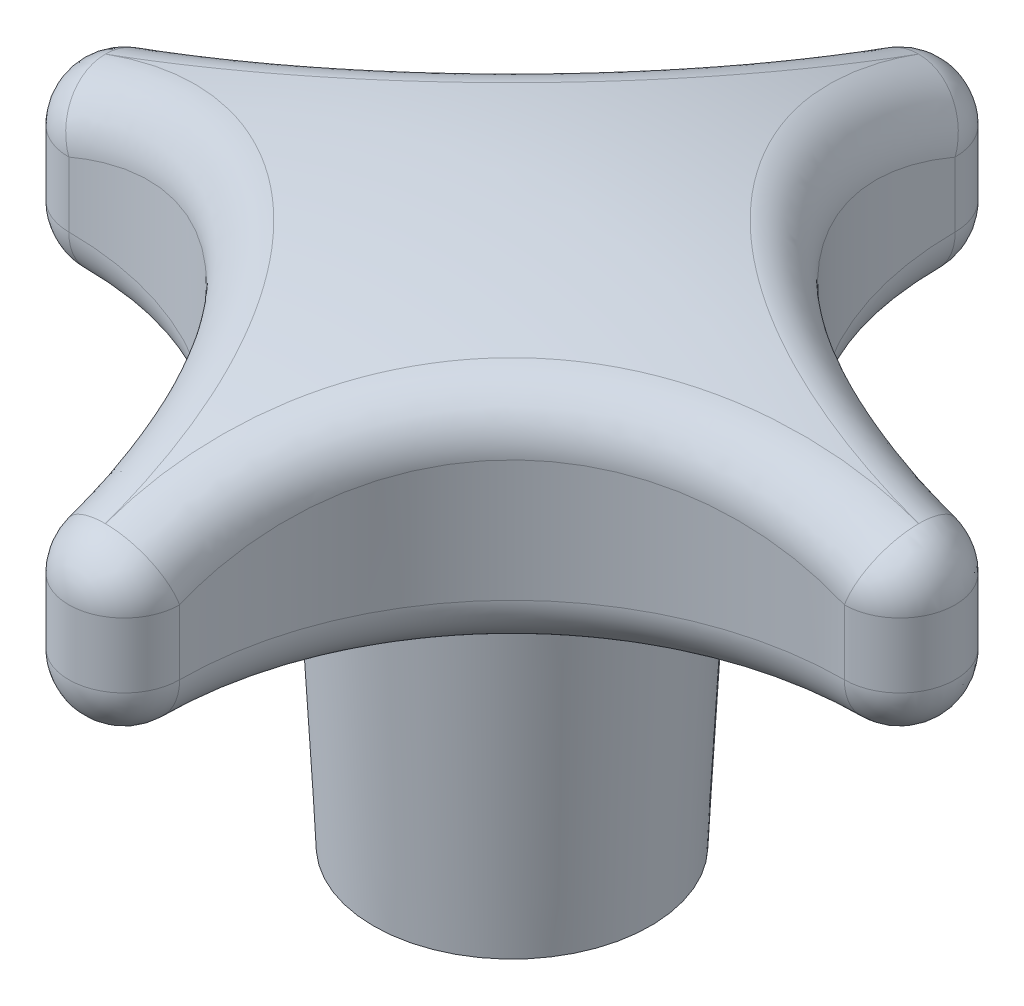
ISO-10303-21;
HEADER;
FILE_DESCRIPTION(('STEP AP214'),'2;1');
FILE_NAME('part.step','',(''),(''),'','','');
FILE_SCHEMA(('AUTOMOTIVE_DESIGN { 1 0 10303 214 1 1 1 1 }'));
ENDSEC;
DATA;
#1=APPLICATION_CONTEXT('core data for automotive mechanical design processes');
#2=APPLICATION_PROTOCOL_DEFINITION('international standard','automotive_design',2000,#1);
#3=PRODUCT_CONTEXT('',#1,'mechanical');
#4=PRODUCT('Part','Part','',(#3));
#5=PRODUCT_RELATED_PRODUCT_CATEGORY('part','',(#4));
#6=PRODUCT_DEFINITION_FORMATION('','',#4);
#7=PRODUCT_DEFINITION_CONTEXT('part definition',#1,'design');
#8=PRODUCT_DEFINITION('design','',#6,#7);
#9=PRODUCT_DEFINITION_SHAPE('','',#8);
#10=(LENGTH_UNIT() NAMED_UNIT(*) SI_UNIT(.MILLI.,.METRE.));
#11=(NAMED_UNIT(*) PLANE_ANGLE_UNIT() SI_UNIT($,.RADIAN.));
#12=(NAMED_UNIT(*) SI_UNIT($,.STERADIAN.) SOLID_ANGLE_UNIT());
#13=UNCERTAINTY_MEASURE_WITH_UNIT(LENGTH_MEASURE(1.E-05),#10,'distance_accuracy_value','');
#14=(GEOMETRIC_REPRESENTATION_CONTEXT(3) GLOBAL_UNCERTAINTY_ASSIGNED_CONTEXT((#13)) GLOBAL_UNIT_ASSIGNED_CONTEXT((#10,
#11,#12)) REPRESENTATION_CONTEXT('',''));
#15=CARTESIAN_POINT('',(0.,0.,0.));
#16=DIRECTION('',(0.,0.,1.));
#17=DIRECTION('',(1.,0.,0.));
#18=AXIS2_PLACEMENT_3D('',#15,#16,#17);
#19=CARTESIAN_POINT('',(0.,-85.7461038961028,0.));
#20=DIRECTION('',(0.,-1.,0.));
#21=DIRECTION('',(1.,0.,0.));
#22=AXIS2_PLACEMENT_3D('',#19,#20,#21);
#23=SPHERICAL_SURFACE('',#22,107.746103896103);
#24=CARTESIAN_POINT('',(-45.4260701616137,5.50948791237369,6.86999713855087));
#25=CARTESIAN_POINT('',(-47.811696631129,10.6709628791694,7.75420284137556));
#26=CARTESIAN_POINT('',(-49.4589084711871,9.95031770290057,2.28783101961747));
#27=CARTESIAN_POINT('',(-44.6147524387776,6.00713444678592,6.56920938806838));
#28=CARTESIAN_POINT('',(-46.9657144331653,11.1176727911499,7.36275900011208));
#29=CARTESIAN_POINT('',(-48.4663091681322,10.4721815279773,1.91983497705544));
#30=CARTESIAN_POINT('',(-43.7857141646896,6.49359463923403,6.30194379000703));
#31=CARTESIAN_POINT('',(-46.0906154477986,11.5594271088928,7.00568573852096));
#32=CARTESIAN_POINT('',(-47.4520298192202,10.9823146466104,1.59285130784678));
#33=CARTESIAN_POINT('',(-42.0970199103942,7.44147869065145,5.83840915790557));
#34=CARTESIAN_POINT('',(-44.3018208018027,12.4219272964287,6.37356108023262));
#35=CARTESIAN_POINT('',(-45.3860121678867,11.9763261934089,1.02574407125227));
#36=CARTESIAN_POINT('',(-41.2373410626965,7.90288317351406,5.6421944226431));
#37=CARTESIAN_POINT('',(-43.3878911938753,12.8432886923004,6.0972131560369));
#38=CARTESIAN_POINT('',(-44.3342458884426,12.4601843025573,0.785686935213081));
#39=CARTESIAN_POINT('',(-39.4912914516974,8.79832737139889,5.32479404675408));
#40=CARTESIAN_POINT('',(-41.5264112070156,13.6623243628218,5.63127781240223));
#41=CARTESIAN_POINT('',(-42.198057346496,13.39920408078,0.397366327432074));
#42=CARTESIAN_POINT('',(-38.6048600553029,9.23229674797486,5.20379475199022));
#43=CARTESIAN_POINT('',(-40.5783554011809,14.0606052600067,5.44061351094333));
#44=CARTESIAN_POINT('',(-41.1135609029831,13.8542919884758,0.249330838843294));
#45=CARTESIAN_POINT('',(-36.8140784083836,10.0683240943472,5.04141375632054));
#46=CARTESIAN_POINT('',(-38.6590868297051,14.8287845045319,5.15153974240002));
#47=CARTESIAN_POINT('',(-38.922645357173,14.7310034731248,0.0506672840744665));
#48=CARTESIAN_POINT('',(-35.9097347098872,10.4703934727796,5.00000346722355));
#49=CARTESIAN_POINT('',(-37.6872830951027,15.199359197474,5.05192286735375));
#50=CARTESIAN_POINT('',(-37.8162342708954,15.1526390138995,4.24193149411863E-06));
#51=CARTESIAN_POINT('',(-34.2235833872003,11.1831344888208,4.99999704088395));
#52=CARTESIAN_POINT('',(-35.8713862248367,15.8572908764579,4.95610858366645));
#53=CARTESIAN_POINT('',(-35.75332774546,15.900064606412,-3.62029357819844E-06));
#54=CARTESIAN_POINT('',(-33.4432400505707,11.4985653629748,5.030154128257));
#55=CARTESIAN_POINT('',(-35.0300796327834,16.1489121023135,4.94625745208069));
#56=CARTESIAN_POINT('',(-34.7986237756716,16.2308454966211,0.0368917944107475));
#57=CARTESIAN_POINT('',(-31.8796288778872,12.101918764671,5.15241994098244));
#58=CARTESIAN_POINT('',(-33.3428848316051,16.7070337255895,4.99814861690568));
#59=CARTESIAN_POINT('',(-32.8856378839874,16.8635602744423,0.18647679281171));
#60=CARTESIAN_POINT('',(-31.0963614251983,12.3898447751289,5.24452081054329));
#61=CARTESIAN_POINT('',(-32.4964091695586,16.9739426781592,5.05933431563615));
#62=CARTESIAN_POINT('',(-31.9273564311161,17.1654978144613,0.299156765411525));
#63=CARTESIAN_POINT('',(-29.5333029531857,12.9358530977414,5.49168913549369));
#64=CARTESIAN_POINT('',(-30.8064360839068,17.4802647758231,5.25446941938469));
#65=CARTESIAN_POINT('',(-30.0150467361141,17.7380768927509,0.601552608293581));
#66=CARTESIAN_POINT('',(-28.7535086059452,13.1939765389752,5.6466684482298));
#67=CARTESIAN_POINT('',(-29.9622746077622,17.7201016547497,5.38787779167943));
#68=CARTESIAN_POINT('',(-29.061014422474,18.0087615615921,0.791160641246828));
#69=CARTESIAN_POINT('',(-27.2019951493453,13.6789429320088,6.02021809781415));
#70=CARTESIAN_POINT('',(-28.2825655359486,18.1707634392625,5.72802045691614));
#71=CARTESIAN_POINT('',(-27.1628293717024,18.5173281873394,1.24817656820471));
#72=CARTESIAN_POINT('',(-26.4302760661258,13.9057857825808,6.23878864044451));
#73=CARTESIAN_POINT('',(-27.4462808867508,18.381951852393,5.9344379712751));
#74=CARTESIAN_POINT('',(-26.2186766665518,18.7552100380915,1.51558471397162));
#75=CARTESIAN_POINT('',(-24.8978685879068,14.3272354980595,6.74049733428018));
#76=CARTESIAN_POINT('',(-25.786177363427,18.7742802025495,6.4214185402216));
#77=CARTESIAN_POINT('',(-24.343866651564,19.1971690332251,2.12939565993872));
#78=CARTESIAN_POINT('',(-24.1372364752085,14.5217101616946,7.02388957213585));
#79=CARTESIAN_POINT('',(-24.9616091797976,18.9556349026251,6.70209323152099));
#80=CARTESIAN_POINT('',(-23.4132781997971,19.4011075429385,2.47610932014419));
#81=CARTESIAN_POINT('',(-22.6364376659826,14.8756740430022,7.65398296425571));
#82=CARTESIAN_POINT('',(-23.3357727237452,19.2856272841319,7.33617749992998));
#83=CARTESIAN_POINT('',(-21.5771395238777,19.7722965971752,3.24699135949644));
#84=CARTESIAN_POINT('',(-21.8962711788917,15.0351629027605,8.00068476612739));
#85=CARTESIAN_POINT('',(-22.5336800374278,19.4345566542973,7.68954504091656));
#86=CARTESIAN_POINT('',(-20.6715895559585,19.9395467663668,3.67116053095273));
#87=CARTESIAN_POINT('',(-20.4426048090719,15.3177605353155,8.75589105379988));
#88=CARTESIAN_POINT('',(-20.9601065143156,19.6983233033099,8.46710027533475));
#89=CARTESIAN_POINT('',(-18.8931146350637,20.2358966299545,4.59511080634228));
#90=CARTESIAN_POINT('',(-19.7291109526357,15.4408611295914,9.16440940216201));
#91=CARTESIAN_POINT('',(-20.1878034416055,19.813394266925,8.89140978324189));
#92=CARTESIAN_POINT('',(-18.0201970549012,20.3649877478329,5.0949088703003));
#93=CARTESIAN_POINT('',(-18.3352752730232,15.6494810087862,10.0407427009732));
#94=CARTESIAN_POINT('',(-18.6813856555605,20.0082837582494,9.80778859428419));
#95=CARTESIAN_POINT('',(-16.314921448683,20.5837598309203,6.16705088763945));
#96=CARTESIAN_POINT('',(-17.6549317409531,15.7350022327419,10.5085545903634));
#97=CARTESIAN_POINT('',(-17.9464641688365,20.0882869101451,10.3001077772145));
#98=CARTESIAN_POINT('',(-15.4825613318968,20.6734428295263,6.73939109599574));
#99=CARTESIAN_POINT('',(-16.3694645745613,15.8640333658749,11.4731368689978));
#100=CARTESIAN_POINT('',(-16.5606211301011,20.2089045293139,11.3199620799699));
#101=CARTESIAN_POINT('',(-13.9098681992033,20.8087530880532,7.91950052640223));
#102=CARTESIAN_POINT('',(-15.7622622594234,15.9095784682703,11.9669404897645));
#103=CARTESIAN_POINT('',(-15.9067072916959,20.2515259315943,11.8444162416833));
#104=CARTESIAN_POINT('',(-13.1669920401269,20.8565145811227,8.5236400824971));
#105=CARTESIAN_POINT('',(-14.5876798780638,15.9659484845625,13.0011495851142));
#106=CARTESIAN_POINT('',(-14.6448156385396,20.3042340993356,12.9461876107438));
#107=CARTESIAN_POINT('',(-11.7299598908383,20.915627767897,9.7889338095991));
#108=CARTESIAN_POINT('',(-14.0202983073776,15.9767747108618,13.5415532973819));
#109=CARTESIAN_POINT('',(-14.0362609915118,20.3143675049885,13.523939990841));
#110=CARTESIAN_POINT('',(-11.0358020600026,20.9269808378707,10.4500858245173));
#111=CARTESIAN_POINT('',(-12.9298092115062,15.9636140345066,14.6648256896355));
#112=CARTESIAN_POINT('',(-12.8702112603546,20.3020608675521,14.7273860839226));
#113=CARTESIAN_POINT('',(-9.7016530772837,20.9131797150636,11.8243432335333));
#114=CARTESIAN_POINT('',(-12.4066932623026,15.9396337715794,15.247686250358));
#115=CARTESIAN_POINT('',(-12.3122116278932,20.2796164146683,15.3535977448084));
#116=CARTESIAN_POINT('',(-9.06165161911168,20.8880324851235,12.5374386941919));
#117=CARTESIAN_POINT('',(-11.4084308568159,15.8570839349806,16.4514359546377));
#118=CARTESIAN_POINT('',(-11.2515126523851,20.2024357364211,16.6486816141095));
#119=CARTESIAN_POINT('',(-7.84033654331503,20.8014654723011,14.0101553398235));
#120=CARTESIAN_POINT('',(-10.9332840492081,15.7985146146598,17.072324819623));
#121=CARTESIAN_POINT('',(-10.7484136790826,20.1476334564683,17.3181539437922));
#122=CARTESIAN_POINT('',(-7.25902249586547,20.7400459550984,14.7697761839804));
#123=CARTESIAN_POINT('',(-10.0473360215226,15.6495152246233,18.3285291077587));
#124=CARTESIAN_POINT('',(-9.81505699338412,20.0083863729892,18.6737386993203));
#125=CARTESIAN_POINT('',(-6.17511742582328,20.5837957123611,16.3066679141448));
#126=CARTESIAN_POINT('',(-9.63505856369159,15.5600678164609,18.9628904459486));
#127=CARTESIAN_POINT('',(-9.38280219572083,19.9247412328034,19.3594343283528));
#128=CARTESIAN_POINT('',(-5.67072031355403,20.4899954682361,17.0827715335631));
#129=CARTESIAN_POINT('',(-8.86106882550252,15.3497862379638,20.2580402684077));
#130=CARTESIAN_POINT('',(-8.57645584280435,19.7283409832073,20.7599290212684));
#131=CARTESIAN_POINT('',(-4.72378959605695,20.2694808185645,18.6673108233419));
#132=CARTESIAN_POINT('',(-8.4993548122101,15.2289531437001,20.9188278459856));
#133=CARTESIAN_POINT('',(-8.2021975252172,19.6154327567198,21.475355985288));
#134=CARTESIAN_POINT('',(-4.28125387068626,20.1427675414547,19.4757453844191));
#135=CARTESIAN_POINT('',(-7.82831467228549,14.9568802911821,22.2617587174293));
#136=CARTESIAN_POINT('',(-7.51385404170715,19.3615408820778,22.9293610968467));
#137=CARTESIAN_POINT('',(-3.46027590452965,19.8574546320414,21.1187419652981));
#138=CARTESIAN_POINT('',(-7.51897208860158,14.8056501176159,22.9438952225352));
#139=CARTESIAN_POINT('',(-7.19969016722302,19.2203717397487,23.6685731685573));
#140=CARTESIAN_POINT('',(-3.08181352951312,19.6988650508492,21.9532956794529));
#141=CARTESIAN_POINT('',(-6.95365023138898,14.4738834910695,24.3248415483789));
#142=CARTESIAN_POINT('',(-6.63258179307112,18.9111185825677,25.164628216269));
#143=CARTESIAN_POINT('',(-2.39017563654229,19.3509534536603,23.6428019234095));
#144=CARTESIAN_POINT('',(-6.69767385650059,14.2933454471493,25.0236522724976));
#145=CARTESIAN_POINT('',(-6.37968611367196,18.7428037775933,25.9221071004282));
#146=CARTESIAN_POINT('',(-2.07700366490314,19.1616297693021,24.4977555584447));
#147=CARTESIAN_POINT('',(-6.2218009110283,13.8890685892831,26.4880551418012));
#148=CARTESIAN_POINT('',(-5.91827932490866,18.3664012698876,27.5088463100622));
#149=CARTESIAN_POINT('',(-1.49480123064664,18.7376793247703,26.2893659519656));
#150=CARTESIAN_POINT('',(-6.0062707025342,13.6630595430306,27.2546075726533));
#151=CARTESIAN_POINT('',(-5.71503754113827,18.1560011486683,28.3395120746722));
#152=CARTESIAN_POINT('',(-1.23111275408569,18.5006718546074,27.22719756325));
#153=CARTESIAN_POINT('',(-5.63789951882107,13.1802267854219,28.7955848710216));
#154=CARTESIAN_POINT('',(-5.38021584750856,17.7073398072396,30.0077810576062));
#155=CARTESIAN_POINT('',(-0.780432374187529,17.9943426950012,29.1124922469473));
#156=CARTESIAN_POINT('',(-5.48506193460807,12.9234014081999,29.570010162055));
#157=CARTESIAN_POINT('',(-5.2489528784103,17.4687206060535,30.8461047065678));
#158=CARTESIAN_POINT('',(-0.593444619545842,17.7250192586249,30.0599558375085));
#159=CARTESIAN_POINT('',(-5.2412510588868,12.3803396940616,31.1224643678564));
#160=CARTESIAN_POINT('',(-5.05706521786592,16.9651457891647,32.5245765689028));
#161=CARTESIAN_POINT('',(-0.295156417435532,17.1555301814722,31.9592918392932));
#162=CARTESIAN_POINT('',(-5.15038405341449,12.0940537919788,31.900497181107));
#163=CARTESIAN_POINT('',(-4.99699511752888,16.6997669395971,33.3653727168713));
#164=CARTESIAN_POINT('',(-0.183986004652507,16.8553125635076,32.9111690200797));
#165=CARTESIAN_POINT('',(-5.02975303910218,11.4943592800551,33.4536442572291));
#166=CARTESIAN_POINT('',(-4.94638911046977,16.1450398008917,35.0412500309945));
#167=CARTESIAN_POINT('',(-0.0364010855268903,16.2264347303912,34.8113527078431));
#168=CARTESIAN_POINT('',(-4.99999689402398,11.1809471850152,34.2287581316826));
#169=CARTESIAN_POINT('',(-4.95639957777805,15.8552909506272,35.8769063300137));
#170=CARTESIAN_POINT('',(3.79996774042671E-06,15.8977708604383,35.7596587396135));
#171=CARTESIAN_POINT('',(-5.00000366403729,10.4703601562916,35.9098133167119));
#172=CARTESIAN_POINT('',(-5.05192769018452,15.1993281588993,37.6873684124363));
#173=CARTESIAN_POINT('',(-4.48272072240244E-06,15.1526040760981,37.8163304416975));
#174=CARTESIAN_POINT('',(-5.04142115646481,10.068252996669,36.8142382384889));
#175=CARTESIAN_POINT('',(-5.15155756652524,14.8287186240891,38.6592594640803));
#176=CARTESIAN_POINT('',(-0.050676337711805,14.730928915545,38.9228408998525));
#177=CARTESIAN_POINT('',(-5.20383148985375,9.23214063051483,38.6051869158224));
#178=CARTESIAN_POINT('',(-5.44067467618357,14.0604614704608,40.5787065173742));
#179=CARTESIAN_POINT('',(-0.249375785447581,13.854128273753,41.1139607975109));
#180=CARTESIAN_POINT('',(-5.32485383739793,8.79812364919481,39.491703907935));
#181=CARTESIAN_POINT('',(-5.6313706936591,13.6621370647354,41.5268531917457));
#182=CARTESIAN_POINT('',(-0.397439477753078,13.3989904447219,42.1985619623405));
#183=CARTESIAN_POINT('',(-5.64228458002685,7.90266378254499,41.2377536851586));
#184=CARTESIAN_POINT('',(-6.09734068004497,12.8430887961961,43.3883290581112));
#185=CARTESIAN_POINT('',(-0.785797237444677,12.4599542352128,44.3347507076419));
#186=CARTESIAN_POINT('',(-5.83849231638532,7.44129663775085,42.0973517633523));
#187=CARTESIAN_POINT('',(-6.3736757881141,12.4217618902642,44.302171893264));
#188=CARTESIAN_POINT('',(-1.02584581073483,11.9761352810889,45.3864181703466));
#189=CARTESIAN_POINT('',(-6.30199730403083,6.49349722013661,43.7858801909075));
#190=CARTESIAN_POINT('',(-7.0057567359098,11.5593392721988,46.0907894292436));
#191=CARTESIAN_POINT('',(-1.59291677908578,10.9822124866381,47.4522329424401));
#192=CARTESIAN_POINT('',(-6.56923949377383,6.00708459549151,44.6148337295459));
#193=CARTESIAN_POINT('',(-7.3627979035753,11.1176283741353,46.9657985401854));
#194=CARTESIAN_POINT('',(-1.91987180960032,10.4721292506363,48.4664086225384));
#195=CARTESIAN_POINT('',(-6.86999713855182,5.50948791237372,45.4260701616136));
#196=CARTESIAN_POINT('',(-7.75420284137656,10.6709628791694,47.8116966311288));
#197=CARTESIAN_POINT('',(-2.2878310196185,9.95031770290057,49.458908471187));
#198=(BOUNDED_SURFACE() B_SPLINE_SURFACE(3,2,((#24,#25,#26),(#27,#28,#29),(#30,#31,#32),(#33,
#34,#35),(#36,#37,#38),(#39,#40,#41),(#42,#43,#44),(#45,#46,#47),(#48,#49,#50),(#51,#52,#53),
(#54,#55,#56),(#57,#58,#59),(#60,#61,#62),(#63,#64,#65),(#66,#67,#68),(#69,#70,#71),(#72,#73,
#74),(#75,#76,#77),(#78,#79,#80),(#81,#82,#83),(#84,#85,#86),(#87,#88,#89),(#90,#91,#92),(#93,
#94,#95),(#96,#97,#98),(#99,#100,#101),(#102,#103,#104),(#105,#106,#107),(#108,#109,#110),(#111,
#112,#113),(#114,#115,#116),(#117,#118,#119),(#120,#121,#122),(#123,#124,#125),(#126,#127,#128),
(#129,#130,#131),(#132,#133,#134),(#135,#136,#137),(#138,#139,#140),(#141,#142,#143),(#144,#145,
#146),(#147,#148,#149),(#150,#151,#152),(#153,#154,#155),(#156,#157,#158),(#159,#160,#161),
(#162,#163,#164),(#165,#166,#167),(#168,#169,#170),(#171,#172,#173),(#174,#175,#176),(#177,#178,
#179),(#180,#181,#182),(#183,#184,#185),(#186,#187,#188),(#189,#190,#191),(#192,#193,#194),
(#195,#196,#197)),.UNSPECIFIED.,.F.,.F.,.F.) B_SPLINE_SURFACE_WITH_KNOTS((4,2,2,2,2,2,2,2,2,2,2,
2,2,2,2,2,2,2,2,2,2,2,2,2,2,2,2,2,4),(3,3),(0.,3.3759280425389,6.7544306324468,10.1412704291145,
13.5268934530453,16.4163665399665,19.3054732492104,22.190543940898,25.0756239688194,
27.9722127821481,30.8688312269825,33.7661002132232,36.663219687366,39.4024819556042,
42.1416406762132,44.8802769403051,47.6188931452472,50.2773563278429,52.9357283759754,
55.5932635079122,58.2509429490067,61.1157387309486,63.9806894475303,66.8505415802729,
69.7207629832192,73.1066860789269,76.4938649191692,79.8720661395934,83.247656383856),(0.,1.),
.UNSPECIFIED.) GEOMETRIC_REPRESENTATION_ITEM() RATIONAL_B_SPLINE_SURFACE(((1.,0.655888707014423,
1.),(1.,0.660702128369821,1.),(1.,0.665393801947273,1.),(1.,0.674513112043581,1.),(1.,
0.678940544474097,1.),(1.,0.687513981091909,1.),(1.,0.691659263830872,1.),(1.,0.699629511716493,
1.),(1.,0.703454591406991,1.),(1.,0.710223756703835,1.),(1.,0.713214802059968,1.),(1.,
0.718928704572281,1.),(1.,0.721651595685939,1.),(1.,0.726809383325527,1.),(1.,0.729244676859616,
1.),(1.,0.733815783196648,1.),(1.,0.735951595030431,1.),(1.,0.739916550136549,1.),(1.,
0.741744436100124,1.),(1.,0.745069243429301,1.),(1.,0.746566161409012,1.),(1.,0.749217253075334,
1.),(1.,0.7503713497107,1.),(1.,0.752326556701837,1.),(1.,0.753127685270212,1.),(1.,
0.754336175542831,1.),(1.,0.754762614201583,1.),(1.,0.755290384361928,1.),(1.,0.755391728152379,
1.),(1.,0.755268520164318,1.),(1.,0.755044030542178,1.),(1.,0.75427107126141,1.),(1.,
0.753722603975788,1.),(1.,0.75232680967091,1.),(1.,0.751488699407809,1.),(1.,0.749517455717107,
1.),(1.,0.748384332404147,1.),(1.,0.745831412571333,1.),(1.,0.744411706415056,1.),(1.,
0.741294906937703,1.),(1.,0.739597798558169,1.),(1.,0.73579422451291,1.),(1.,0.733666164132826,
1.),(1.,0.729114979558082,1.),(1.,0.726691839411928,1.),(1.,0.721561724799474,1.),(1.,
0.718854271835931,1.),(1.,0.713174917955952,1.),(1.,0.71020298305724,1.),(1.,0.703454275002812,
1.),(1.,0.699628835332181,1.),(1.,0.691657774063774,1.),(1.,0.687512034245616,1.),(1.,
0.67893844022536,1.),(1.,0.674511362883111,1.),(1.,0.665392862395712,1.),(1.,0.660701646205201,
1.),(1.,0.655888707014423,1.))) REPRESENTATION_ITEM('') SURFACE());
#199=CARTESIAN_POINT('',(-49.4589084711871,9.95031770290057,2.28783101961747));
#200=CARTESIAN_POINT('',(-48.4663091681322,10.4721815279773,1.91983497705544));
#201=CARTESIAN_POINT('',(-47.4520298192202,10.9823146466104,1.59285130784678));
#202=CARTESIAN_POINT('',(-45.3860121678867,11.9763261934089,1.02574407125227));
#203=CARTESIAN_POINT('',(-44.3342458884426,12.4601843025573,0.785686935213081));
#204=CARTESIAN_POINT('',(-42.198057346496,13.39920408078,0.397366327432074));
#205=CARTESIAN_POINT('',(-41.1135609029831,13.8542919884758,0.249330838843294));
#206=CARTESIAN_POINT('',(-38.922645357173,14.7310034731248,0.0506672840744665));
#207=CARTESIAN_POINT('',(-37.8162342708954,15.1526390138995,4.24193149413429E-06));
#208=CARTESIAN_POINT('',(-35.75332774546,15.900064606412,-3.62029357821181E-06));
#209=CARTESIAN_POINT('',(-34.7986237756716,16.2308454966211,0.0368917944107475));
#210=CARTESIAN_POINT('',(-32.8856378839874,16.8635602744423,0.18647679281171));
#211=CARTESIAN_POINT('',(-31.9273564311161,17.1654978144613,0.299156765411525));
#212=CARTESIAN_POINT('',(-30.0150467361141,17.7380768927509,0.601552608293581));
#213=CARTESIAN_POINT('',(-29.061014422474,18.0087615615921,0.791160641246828));
#214=CARTESIAN_POINT('',(-27.1628293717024,18.5173281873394,1.24817656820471));
#215=CARTESIAN_POINT('',(-26.2186766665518,18.7552100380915,1.51558471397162));
#216=CARTESIAN_POINT('',(-24.343866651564,19.1971690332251,2.12939565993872));
#217=CARTESIAN_POINT('',(-23.4132781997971,19.4011075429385,2.47610932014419));
#218=CARTESIAN_POINT('',(-21.5771395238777,19.7722965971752,3.24699135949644));
#219=CARTESIAN_POINT('',(-20.6715895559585,19.9395467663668,3.67116053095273));
#220=CARTESIAN_POINT('',(-18.8931146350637,20.2358966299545,4.59511080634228));
#221=CARTESIAN_POINT('',(-18.0201970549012,20.3649877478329,5.0949088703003));
#222=CARTESIAN_POINT('',(-16.314921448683,20.5837598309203,6.16705088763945));
#223=CARTESIAN_POINT('',(-15.4825613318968,20.6734428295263,6.73939109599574));
#224=CARTESIAN_POINT('',(-13.9098681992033,20.8087530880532,7.91950052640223));
#225=CARTESIAN_POINT('',(-13.1669920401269,20.8565145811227,8.5236400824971));
#226=CARTESIAN_POINT('',(-11.7299598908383,20.915627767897,9.7889338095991));
#227=CARTESIAN_POINT('',(-11.0358020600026,20.9269808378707,10.4500858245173));
#228=CARTESIAN_POINT('',(-9.70165307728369,20.9131797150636,11.8243432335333));
#229=CARTESIAN_POINT('',(-9.06165161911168,20.8880324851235,12.5374386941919));
#230=CARTESIAN_POINT('',(-7.84033654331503,20.8014654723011,14.0101553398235));
#231=CARTESIAN_POINT('',(-7.25902249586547,20.7400459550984,14.7697761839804));
#232=CARTESIAN_POINT('',(-6.17511742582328,20.5837957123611,16.3066679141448));
#233=CARTESIAN_POINT('',(-5.67072031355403,20.4899954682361,17.0827715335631));
#234=CARTESIAN_POINT('',(-4.72378959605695,20.2694808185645,18.6673108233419));
#235=CARTESIAN_POINT('',(-4.28125387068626,20.1427675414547,19.4757453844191));
#236=CARTESIAN_POINT('',(-3.46027590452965,19.8574546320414,21.1187419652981));
#237=CARTESIAN_POINT('',(-3.08181352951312,19.6988650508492,21.9532956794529));
#238=CARTESIAN_POINT('',(-2.39017563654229,19.3509534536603,23.6428019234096));
#239=CARTESIAN_POINT('',(-2.07700366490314,19.1616297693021,24.4977555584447));
#240=CARTESIAN_POINT('',(-1.49480123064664,18.7376793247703,26.2893659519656));
#241=CARTESIAN_POINT('',(-1.23111275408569,18.5006718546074,27.22719756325));
#242=CARTESIAN_POINT('',(-0.780432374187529,17.9943426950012,29.1124922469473));
#243=CARTESIAN_POINT('',(-0.593444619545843,17.7250192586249,30.0599558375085));
#244=CARTESIAN_POINT('',(-0.295156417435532,17.1555301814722,31.9592918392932));
#245=CARTESIAN_POINT('',(-0.183986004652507,16.8553125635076,32.9111690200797));
#246=CARTESIAN_POINT('',(-0.0364010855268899,16.2264347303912,34.8113527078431));
#247=CARTESIAN_POINT('',(3.79996774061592E-06,15.8977708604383,35.7596587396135));
#248=CARTESIAN_POINT('',(-4.48272072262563E-06,15.1526040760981,37.8163304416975));
#249=CARTESIAN_POINT('',(-0.050676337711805,14.730928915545,38.9228408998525));
#250=CARTESIAN_POINT('',(-0.249375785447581,13.854128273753,41.1139607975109));
#251=CARTESIAN_POINT('',(-0.397439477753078,13.3989904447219,42.1985619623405));
#252=CARTESIAN_POINT('',(-0.785797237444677,12.4599542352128,44.3347507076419));
#253=CARTESIAN_POINT('',(-1.02584581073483,11.9761352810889,45.3864181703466));
#254=CARTESIAN_POINT('',(-1.59291677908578,10.9822124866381,47.4522329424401));
#255=CARTESIAN_POINT('',(-1.91987180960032,10.4721292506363,48.4664086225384));
#256=CARTESIAN_POINT('',(-2.2878310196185,9.95031770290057,49.458908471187));
#257=B_SPLINE_CURVE_WITH_KNOTS('',3,(#199,#200,#201,#202,#203,#204,#205,#206,#207,#208,#209,
#210,#211,#212,#213,#214,#215,#216,#217,#218,#219,#220,#221,#222,#223,#224,#225,#226,#227,#228,
#229,#230,#231,#232,#233,#234,#235,#236,#237,#238,#239,#240,#241,#242,#243,#244,#245,#246,#247,
#248,#249,#250,#251,#252,#253,#254,#255,#256),.UNSPECIFIED.,.F.,.F.,(4,2,2,2,2,2,2,2,2,2,2,2,2,
2,2,2,2,2,2,2,2,2,2,2,2,2,2,2,4),(0.,3.3759280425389,6.7544306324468,10.1412704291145,
13.5268934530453,16.4163665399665,19.3054732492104,22.190543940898,25.0756239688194,
27.9722127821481,30.8688312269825,33.7661002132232,36.663219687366,39.4024819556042,
42.1416406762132,44.8802769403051,47.6188931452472,50.2773563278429,52.9357283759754,
55.5932635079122,58.2509429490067,61.1157387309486,63.9806894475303,66.8505415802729,
69.7207629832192,73.1066860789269,76.4938649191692,79.8720661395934,83.247656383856),.UNSPECIFIED.);
#258=CARTESIAN_POINT('',(-36.7032276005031,15.5558999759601,-3.84543011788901E-13));
#259=VERTEX_POINT('',#258);
#260=CARTESIAN_POINT('',(-3.88185023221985E-13,15.5558999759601,36.7032276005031));
#261=VERTEX_POINT('',#260);
#262=EDGE_CURVE('E355',#259,#261,#257,.T.);
#263=ORIENTED_EDGE('',*,*,#262,.T.);
#264=CARTESIAN_POINT('',(6.86999713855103,5.50948791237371,45.4260701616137));
#265=CARTESIAN_POINT('',(7.75420284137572,10.6709628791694,47.8116966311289));
#266=CARTESIAN_POINT('',(2.28783101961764,9.95031770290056,49.4589084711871));
#267=CARTESIAN_POINT('',(6.56920938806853,6.0071344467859,44.6147524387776));
#268=CARTESIAN_POINT('',(7.36275900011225,11.1176727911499,46.9657144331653));
#269=CARTESIAN_POINT('',(1.91983497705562,10.4721815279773,48.4663091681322));
#270=CARTESIAN_POINT('',(6.30194379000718,6.49359463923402,43.7857141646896));
#271=CARTESIAN_POINT('',(7.00568573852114,11.5594271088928,46.0906154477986));
#272=CARTESIAN_POINT('',(1.59285130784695,10.9823146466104,47.4520298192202));
#273=CARTESIAN_POINT('',(5.83840915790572,7.44147869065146,42.0970199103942));
#274=CARTESIAN_POINT('',(6.37356108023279,12.4219272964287,44.3018208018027));
#275=CARTESIAN_POINT('',(1.02574407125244,11.9763261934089,45.3860121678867));
#276=CARTESIAN_POINT('',(5.64219442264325,7.90288317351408,41.2373410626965));
#277=CARTESIAN_POINT('',(6.09721315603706,12.8432886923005,43.3878911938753));
#278=CARTESIAN_POINT('',(0.78568693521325,12.4601843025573,44.3342458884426));
#279=CARTESIAN_POINT('',(5.32479404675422,8.79832737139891,39.4912914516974));
#280=CARTESIAN_POINT('',(5.63127781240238,13.6623243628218,41.5264112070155));
#281=CARTESIAN_POINT('',(0.397366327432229,13.39920408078,42.198057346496));
#282=CARTESIAN_POINT('',(5.20379475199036,9.23229674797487,38.6048600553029));
#283=CARTESIAN_POINT('',(5.44061351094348,14.0606052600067,40.5783554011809));
#284=CARTESIAN_POINT('',(0.249330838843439,13.8542919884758,41.1135609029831));
#285=CARTESIAN_POINT('',(5.04141375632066,10.0683240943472,36.8140784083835));
#286=CARTESIAN_POINT('',(5.15153974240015,14.8287845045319,38.6590868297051));
#287=CARTESIAN_POINT('',(0.0506672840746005,14.7310034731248,38.922645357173));
#288=CARTESIAN_POINT('',(5.00000346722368,10.4703934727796,35.9097347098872));
#289=CARTESIAN_POINT('',(5.05192286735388,15.199359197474,37.6872830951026));
#290=CARTESIAN_POINT('',(4.24193162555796E-06,15.1526390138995,37.8162342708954));
#291=CARTESIAN_POINT('',(4.99999704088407,11.1831344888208,34.2235833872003));
#292=CARTESIAN_POINT('',(4.95610858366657,15.8572908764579,35.8713862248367));
#293=CARTESIAN_POINT('',(-3.62029345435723E-06,15.900064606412,35.75332774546));
#294=CARTESIAN_POINT('',(5.03015412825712,11.4985653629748,33.4432400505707));
#295=CARTESIAN_POINT('',(4.94625745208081,16.1489121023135,35.0300796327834));
#296=CARTESIAN_POINT('',(0.0368917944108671,16.2308454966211,34.7986237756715));
#297=CARTESIAN_POINT('',(5.15241994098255,12.101918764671,31.8796288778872));
#298=CARTESIAN_POINT('',(4.99814861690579,16.7070337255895,33.3428848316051));
#299=CARTESIAN_POINT('',(0.186476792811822,16.8635602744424,32.8856378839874));
#300=CARTESIAN_POINT('',(5.2445208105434,12.3898447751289,31.0963614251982));
#301=CARTESIAN_POINT('',(5.05933431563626,16.9739426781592,32.4964091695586));
#302=CARTESIAN_POINT('',(0.299156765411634,17.1654978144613,31.9273564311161));
#303=CARTESIAN_POINT('',(5.49168913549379,12.9358530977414,29.5333029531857));
#304=CARTESIAN_POINT('',(5.25446941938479,17.4802647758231,30.8064360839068));
#305=CARTESIAN_POINT('',(0.601552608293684,17.7380768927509,30.0150467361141));
#306=CARTESIAN_POINT('',(5.6466684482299,13.1939765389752,28.7535086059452));
#307=CARTESIAN_POINT('',(5.38787779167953,17.7201016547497,29.9622746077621));
#308=CARTESIAN_POINT('',(0.791160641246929,18.0087615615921,29.061014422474));
#309=CARTESIAN_POINT('',(6.02021809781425,13.6789429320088,27.2019951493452));
#310=CARTESIAN_POINT('',(5.72802045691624,18.1707634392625,28.2825655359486));
#311=CARTESIAN_POINT('',(1.24817656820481,18.5173281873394,27.1628293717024));
#312=CARTESIAN_POINT('',(6.23878864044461,13.9057857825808,26.4302760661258));
#313=CARTESIAN_POINT('',(5.93443797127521,18.381951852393,27.4462808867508));
#314=CARTESIAN_POINT('',(1.51558471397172,18.7552100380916,26.2186766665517));
#315=CARTESIAN_POINT('',(6.74049733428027,14.3272354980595,24.8978685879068));
#316=CARTESIAN_POINT('',(6.42141854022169,18.7742802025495,25.7861773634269));
#317=CARTESIAN_POINT('',(2.12939565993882,19.1971690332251,24.343866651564));
#318=CARTESIAN_POINT('',(7.02388957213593,14.5217101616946,24.1372364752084));
#319=CARTESIAN_POINT('',(6.70209323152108,18.9556349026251,24.9616091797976));
#320=CARTESIAN_POINT('',(2.47610932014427,19.4011075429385,23.4132781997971));
#321=CARTESIAN_POINT('',(7.65398296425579,14.8756740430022,22.6364376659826));
#322=CARTESIAN_POINT('',(7.33617749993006,19.2856272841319,23.3357727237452));
#323=CARTESIAN_POINT('',(3.24699135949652,19.7722965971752,21.5771395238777));
#324=CARTESIAN_POINT('',(8.00068476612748,15.0351629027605,21.8962711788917));
#325=CARTESIAN_POINT('',(7.68954504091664,19.4345566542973,22.5336800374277));
#326=CARTESIAN_POINT('',(3.67116053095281,19.9395467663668,20.6715895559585));
#327=CARTESIAN_POINT('',(8.75589105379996,15.3177605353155,20.4426048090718));
#328=CARTESIAN_POINT('',(8.46710027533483,19.6983233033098,20.9601065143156));
#329=CARTESIAN_POINT('',(4.59511080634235,20.2358966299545,18.8931146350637));
#330=CARTESIAN_POINT('',(9.16440940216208,15.4408611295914,19.7291109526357));
#331=CARTESIAN_POINT('',(8.89140978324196,19.813394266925,20.1878034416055));
#332=CARTESIAN_POINT('',(5.09490887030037,20.3649877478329,18.0201970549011));
#333=CARTESIAN_POINT('',(10.0407427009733,15.6494810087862,18.3352752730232));
#334=CARTESIAN_POINT('',(9.80778859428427,20.0082837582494,18.6813856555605));
#335=CARTESIAN_POINT('',(6.16705088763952,20.5837598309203,16.314921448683));
#336=CARTESIAN_POINT('',(10.5085545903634,15.7350022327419,17.654931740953));
#337=CARTESIAN_POINT('',(10.3001077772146,20.0882869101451,17.9464641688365));
#338=CARTESIAN_POINT('',(6.73939109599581,20.6734428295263,15.4825613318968));
#339=CARTESIAN_POINT('',(11.4731368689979,15.8640333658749,16.3694645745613));
#340=CARTESIAN_POINT('',(11.3199620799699,20.2089045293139,16.560621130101));
#341=CARTESIAN_POINT('',(7.9195005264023,20.8087530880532,13.9098681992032));
#342=CARTESIAN_POINT('',(11.9669404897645,15.9095784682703,15.7622622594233));
#343=CARTESIAN_POINT('',(11.8444162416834,20.2515259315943,15.9067072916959));
#344=CARTESIAN_POINT('',(8.52364008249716,20.8565145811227,13.1669920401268));
#345=CARTESIAN_POINT('',(13.0011495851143,15.9659484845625,14.5876798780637));
#346=CARTESIAN_POINT('',(12.9461876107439,20.3042340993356,14.6448156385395));
#347=CARTESIAN_POINT('',(9.78893380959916,20.915627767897,11.7299598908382));
#348=CARTESIAN_POINT('',(13.541553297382,15.9767747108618,14.0202983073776));
#349=CARTESIAN_POINT('',(13.5239399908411,20.3143675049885,14.0362609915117));
#350=CARTESIAN_POINT('',(10.4500858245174,20.9269808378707,11.0358020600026));
#351=CARTESIAN_POINT('',(14.6648256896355,15.9636140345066,12.9298092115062));
#352=CARTESIAN_POINT('',(14.7273860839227,20.3020608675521,12.8702112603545));
#353=CARTESIAN_POINT('',(11.8243432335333,20.9131797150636,9.70165307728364));
#354=CARTESIAN_POINT('',(15.2476862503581,15.9396337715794,12.4066932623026));
#355=CARTESIAN_POINT('',(15.3535977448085,20.2796164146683,12.3122116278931));
#356=CARTESIAN_POINT('',(12.537438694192,20.8880324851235,9.06165161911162));
#357=CARTESIAN_POINT('',(16.4514359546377,15.8570839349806,11.4084308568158));
#358=CARTESIAN_POINT('',(16.6486816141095,20.2024357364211,11.251512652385));
#359=CARTESIAN_POINT('',(14.0101553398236,20.8014654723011,7.84033654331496));
#360=CARTESIAN_POINT('',(17.0723248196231,15.7985146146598,10.933284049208));
#361=CARTESIAN_POINT('',(17.3181539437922,20.1476334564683,10.7484136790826));
#362=CARTESIAN_POINT('',(14.7697761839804,20.7400459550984,7.2590224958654));
#363=CARTESIAN_POINT('',(18.3285291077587,15.6495152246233,10.0473360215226));
#364=CARTESIAN_POINT('',(18.6737386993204,20.0083863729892,9.81505699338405));
#365=CARTESIAN_POINT('',(16.3066679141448,20.5837957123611,6.17511742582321));
#366=CARTESIAN_POINT('',(18.9628904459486,15.5600678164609,9.63505856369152));
#367=CARTESIAN_POINT('',(19.3594343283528,19.9247412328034,9.38280219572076));
#368=CARTESIAN_POINT('',(17.0827715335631,20.4899954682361,5.67072031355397));
#369=CARTESIAN_POINT('',(20.2580402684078,15.3497862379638,8.86106882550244));
#370=CARTESIAN_POINT('',(20.7599290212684,19.7283409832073,8.57645584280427));
#371=CARTESIAN_POINT('',(18.6673108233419,20.2694808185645,4.72378959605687));
#372=CARTESIAN_POINT('',(20.9188278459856,15.2289531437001,8.49935481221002));
#373=CARTESIAN_POINT('',(21.4753559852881,19.6154327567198,8.20219752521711));
#374=CARTESIAN_POINT('',(19.4757453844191,20.1427675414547,4.28125387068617));
#375=CARTESIAN_POINT('',(22.2617587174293,14.9568802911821,7.8283146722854));
#376=CARTESIAN_POINT('',(22.9293610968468,19.3615408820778,7.51385404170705));
#377=CARTESIAN_POINT('',(21.1187419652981,19.8574546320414,3.46027590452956));
#378=CARTESIAN_POINT('',(22.9438952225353,14.8056501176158,7.51897208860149));
#379=CARTESIAN_POINT('',(23.6685731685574,19.2203717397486,7.19969016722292));
#380=CARTESIAN_POINT('',(21.9532956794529,19.6988650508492,3.08181352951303));
#381=CARTESIAN_POINT('',(24.324841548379,14.4738834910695,6.95365023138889));
#382=CARTESIAN_POINT('',(25.164628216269,18.9111185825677,6.63258179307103));
#383=CARTESIAN_POINT('',(23.6428019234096,19.3509534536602,2.3901756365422));
#384=CARTESIAN_POINT('',(25.0236522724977,14.2933454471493,6.6976738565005));
#385=CARTESIAN_POINT('',(25.9221071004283,18.7428037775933,6.37968611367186));
#386=CARTESIAN_POINT('',(24.4977555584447,19.1616297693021,2.07700366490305));
#387=CARTESIAN_POINT('',(26.4880551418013,13.8890685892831,6.22180091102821));
#388=CARTESIAN_POINT('',(27.5088463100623,18.3664012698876,5.91827932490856));
#389=CARTESIAN_POINT('',(26.2893659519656,18.7376793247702,1.49480123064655));
#390=CARTESIAN_POINT('',(27.2546075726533,13.6630595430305,6.0062707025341));
#391=CARTESIAN_POINT('',(28.3395120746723,18.1560011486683,5.71503754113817));
#392=CARTESIAN_POINT('',(27.22719756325,18.5006718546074,1.23111275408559));
#393=CARTESIAN_POINT('',(28.7955848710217,13.1802267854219,5.63789951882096));
#394=CARTESIAN_POINT('',(30.0077810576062,17.7073398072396,5.38021584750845));
#395=CARTESIAN_POINT('',(29.1124922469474,17.9943426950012,0.780432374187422));
#396=CARTESIAN_POINT('',(29.5700101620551,12.9234014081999,5.48506193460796));
#397=CARTESIAN_POINT('',(30.8461047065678,17.4687206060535,5.24895287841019));
#398=CARTESIAN_POINT('',(30.0599558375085,17.7250192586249,0.593444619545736));
#399=CARTESIAN_POINT('',(31.1224643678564,12.3803396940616,5.24125105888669));
#400=CARTESIAN_POINT('',(32.5245765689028,16.9651457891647,5.0570652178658));
#401=CARTESIAN_POINT('',(31.9592918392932,17.1555301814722,0.295156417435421));
#402=CARTESIAN_POINT('',(31.900497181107,12.0940537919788,5.15038405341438));
#403=CARTESIAN_POINT('',(33.3653727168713,16.6997669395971,4.99699511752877));
#404=CARTESIAN_POINT('',(32.9111690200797,16.8553125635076,0.183986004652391));
#405=CARTESIAN_POINT('',(33.4536442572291,11.4943592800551,5.02975303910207));
#406=CARTESIAN_POINT('',(35.0412500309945,16.1450398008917,4.94638911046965));
#407=CARTESIAN_POINT('',(34.811352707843,16.2264347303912,0.0364010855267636));
#408=CARTESIAN_POINT('',(34.2287581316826,11.1809471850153,4.99999689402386));
#409=CARTESIAN_POINT('',(35.8769063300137,15.8552909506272,4.95639957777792));
#410=CARTESIAN_POINT('',(35.7596587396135,15.8977708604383,-3.79996787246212E-06));
#411=CARTESIAN_POINT('',(35.9098133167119,10.4703601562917,5.00000366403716));
#412=CARTESIAN_POINT('',(37.6873684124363,15.1993281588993,5.05192769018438));
#413=CARTESIAN_POINT('',(37.8163304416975,15.1526040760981,4.48272058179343E-06));
#414=CARTESIAN_POINT('',(36.8142382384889,10.068252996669,5.04142115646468));
#415=CARTESIAN_POINT('',(38.6592594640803,14.8287186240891,5.15155756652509));
#416=CARTESIAN_POINT('',(38.9228408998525,14.730928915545,0.0506763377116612));
#417=CARTESIAN_POINT('',(38.6051869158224,9.23214063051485,5.20383148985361));
#418=CARTESIAN_POINT('',(40.5787065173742,14.0604614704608,5.44067467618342));
#419=CARTESIAN_POINT('',(41.1139607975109,13.854128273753,0.249375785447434));
#420=CARTESIAN_POINT('',(39.491703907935,8.79812364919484,5.32485383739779));
#421=CARTESIAN_POINT('',(41.5268531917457,13.6621370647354,5.63137069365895));
#422=CARTESIAN_POINT('',(42.1985619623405,13.3989904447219,0.39743947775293));
#423=CARTESIAN_POINT('',(41.2377536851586,7.90266378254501,5.64228458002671));
#424=CARTESIAN_POINT('',(43.3883290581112,12.8430887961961,6.09734068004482));
#425=CARTESIAN_POINT('',(44.3347507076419,12.4599542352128,0.785797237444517));
#426=CARTESIAN_POINT('',(42.0973517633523,7.44129663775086,5.83849231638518));
#427=CARTESIAN_POINT('',(44.302171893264,12.4217618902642,6.37367578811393));
#428=CARTESIAN_POINT('',(45.3864181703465,11.9761352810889,1.02584581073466));
#429=CARTESIAN_POINT('',(43.7858801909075,6.4934972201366,6.30199730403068));
#430=CARTESIAN_POINT('',(46.0907894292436,11.5593392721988,7.00575673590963));
#431=CARTESIAN_POINT('',(47.4522329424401,10.9822124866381,1.59291677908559));
#432=CARTESIAN_POINT('',(44.6148337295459,6.0070845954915,6.56923949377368));
#433=CARTESIAN_POINT('',(46.9657985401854,11.1176283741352,7.36279790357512));
#434=CARTESIAN_POINT('',(48.4664086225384,10.4721292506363,1.91987180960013));
#435=CARTESIAN_POINT('',(45.4260701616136,5.50948791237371,6.86999713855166));
#436=CARTESIAN_POINT('',(47.8116966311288,10.6709628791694,7.75420284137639));
#437=CARTESIAN_POINT('',(49.458908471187,9.95031770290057,2.28783101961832));
#438=(BOUNDED_SURFACE() B_SPLINE_SURFACE(3,2,((#264,#265,#266),(#267,#268,#269),(#270,#271,
#272),(#273,#274,#275),(#276,#277,#278),(#279,#280,#281),(#282,#283,#284),(#285,#286,#287),
(#288,#289,#290),(#291,#292,#293),(#294,#295,#296),(#297,#298,#299),(#300,#301,#302),(#303,#304,
#305),(#306,#307,#308),(#309,#310,#311),(#312,#313,#314),(#315,#316,#317),(#318,#319,#320),
(#321,#322,#323),(#324,#325,#326),(#327,#328,#329),(#330,#331,#332),(#333,#334,#335),(#336,#337,
#338),(#339,#340,#341),(#342,#343,#344),(#345,#346,#347),(#348,#349,#350),(#351,#352,#353),
(#354,#355,#356),(#357,#358,#359),(#360,#361,#362),(#363,#364,#365),(#366,#367,#368),(#369,#370,
#371),(#372,#373,#374),(#375,#376,#377),(#378,#379,#380),(#381,#382,#383),(#384,#385,#386),
(#387,#388,#389),(#390,#391,#392),(#393,#394,#395),(#396,#397,#398),(#399,#400,#401),(#402,#403,
#404),(#405,#406,#407),(#408,#409,#410),(#411,#412,#413),(#414,#415,#416),(#417,#418,#419),
(#420,#421,#422),(#423,#424,#425),(#426,#427,#428),(#429,#430,#431),(#432,#433,#434),(#435,#436,
#437)),.UNSPECIFIED.,.F.,.F.,.F.) B_SPLINE_SURFACE_WITH_KNOTS((4,2,2,2,2,2,2,2,2,2,2,2,2,2,2,2,
2,2,2,2,2,2,2,2,2,2,2,2,4),(3,3),(0.,3.3759280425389,6.75443063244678,10.1412704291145,
13.5268934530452,16.4163665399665,19.3054732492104,22.190543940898,25.0756239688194,
27.9722127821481,30.8688312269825,33.7661002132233,36.663219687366,39.4024819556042,
42.1416406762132,44.8802769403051,47.6188931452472,50.2773563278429,52.9357283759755,
55.5932635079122,58.2509429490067,61.1157387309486,63.9806894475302,66.8505415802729,
69.7207629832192,73.1066860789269,76.4938649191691,79.8720661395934,83.247656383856),(0.,1.),
.UNSPECIFIED.) GEOMETRIC_REPRESENTATION_ITEM() RATIONAL_B_SPLINE_SURFACE(((1.,0.655888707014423,
1.),(1.,0.66070212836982,1.),(1.,0.665393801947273,1.),(1.,0.674513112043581,1.),(1.,
0.678940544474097,1.),(1.,0.687513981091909,1.),(1.,0.691659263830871,1.),(1.,0.699629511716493,
1.),(1.,0.703454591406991,1.),(1.,0.710223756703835,1.),(1.,0.713214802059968,1.),(1.,
0.718928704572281,1.),(1.,0.721651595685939,1.),(1.,0.726809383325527,1.),(1.,0.729244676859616,
1.),(1.,0.733815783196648,1.),(1.,0.735951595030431,1.),(1.,0.739916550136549,1.),(1.,
0.741744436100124,1.),(1.,0.745069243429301,1.),(1.,0.746566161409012,1.),(1.,0.749217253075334,
1.),(1.,0.7503713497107,1.),(1.,0.752326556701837,1.),(1.,0.753127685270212,1.),(1.,
0.754336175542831,1.),(1.,0.754762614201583,1.),(1.,0.755290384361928,1.),(1.,0.755391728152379,
1.),(1.,0.755268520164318,1.),(1.,0.755044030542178,1.),(1.,0.75427107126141,1.),(1.,
0.753722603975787,1.),(1.,0.75232680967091,1.),(1.,0.751488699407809,1.),(1.,0.749517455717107,
1.),(1.,0.748384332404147,1.),(1.,0.745831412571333,1.),(1.,0.744411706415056,1.),(1.,
0.741294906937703,1.),(1.,0.739597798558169,1.),(1.,0.735794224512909,1.),(1.,0.733666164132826,
1.),(1.,0.729114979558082,1.),(1.,0.726691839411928,1.),(1.,0.721561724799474,1.),(1.,
0.718854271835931,1.),(1.,0.713174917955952,1.),(1.,0.71020298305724,1.),(1.,0.703454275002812,
1.),(1.,0.699628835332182,1.),(1.,0.691657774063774,1.),(1.,0.687512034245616,1.),(1.,
0.67893844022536,1.),(1.,0.674511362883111,1.),(1.,0.665392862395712,1.),(1.,0.660701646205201,
1.),(1.,0.655888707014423,1.))) REPRESENTATION_ITEM('') SURFACE());
#439=CARTESIAN_POINT('',(2.28783101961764,9.95031770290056,49.4589084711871));
#440=CARTESIAN_POINT('',(1.91983497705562,10.4721815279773,48.4663091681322));
#441=CARTESIAN_POINT('',(1.59285130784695,10.9823146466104,47.4520298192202));
#442=CARTESIAN_POINT('',(1.02574407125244,11.9763261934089,45.3860121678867));
#443=CARTESIAN_POINT('',(0.78568693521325,12.4601843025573,44.3342458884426));
#444=CARTESIAN_POINT('',(0.397366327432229,13.39920408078,42.198057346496));
#445=CARTESIAN_POINT('',(0.249330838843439,13.8542919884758,41.1135609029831));
#446=CARTESIAN_POINT('',(0.0506672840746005,14.7310034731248,38.922645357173));
#447=CARTESIAN_POINT('',(4.24193162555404E-06,15.1526390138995,37.8162342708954));
#448=CARTESIAN_POINT('',(-3.62029345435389E-06,15.900064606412,35.75332774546));
#449=CARTESIAN_POINT('',(0.0368917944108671,16.2308454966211,34.7986237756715));
#450=CARTESIAN_POINT('',(0.186476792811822,16.8635602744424,32.8856378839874));
#451=CARTESIAN_POINT('',(0.299156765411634,17.1654978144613,31.927356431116));
#452=CARTESIAN_POINT('',(0.601552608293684,17.7380768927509,30.0150467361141));
#453=CARTESIAN_POINT('',(0.791160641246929,18.0087615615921,29.061014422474));
#454=CARTESIAN_POINT('',(1.24817656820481,18.5173281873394,27.1628293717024));
#455=CARTESIAN_POINT('',(1.51558471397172,18.7552100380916,26.2186766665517));
#456=CARTESIAN_POINT('',(2.12939565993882,19.1971690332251,24.343866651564));
#457=CARTESIAN_POINT('',(2.47610932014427,19.4011075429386,23.4132781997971));
#458=CARTESIAN_POINT('',(3.24699135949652,19.7722965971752,21.5771395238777));
#459=CARTESIAN_POINT('',(3.67116053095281,19.9395467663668,20.6715895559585));
#460=CARTESIAN_POINT('',(4.59511080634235,20.2358966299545,18.8931146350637));
#461=CARTESIAN_POINT('',(5.09490887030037,20.3649877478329,18.0201970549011));
#462=CARTESIAN_POINT('',(6.16705088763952,20.5837598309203,16.314921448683));
#463=CARTESIAN_POINT('',(6.73939109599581,20.6734428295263,15.4825613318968));
#464=CARTESIAN_POINT('',(7.91950052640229,20.8087530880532,13.9098681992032));
#465=CARTESIAN_POINT('',(8.52364008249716,20.8565145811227,13.1669920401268));
#466=CARTESIAN_POINT('',(9.78893380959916,20.915627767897,11.7299598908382));
#467=CARTESIAN_POINT('',(10.4500858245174,20.9269808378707,11.0358020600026));
#468=CARTESIAN_POINT('',(11.8243432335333,20.9131797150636,9.70165307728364));
#469=CARTESIAN_POINT('',(12.537438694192,20.8880324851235,9.06165161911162));
#470=CARTESIAN_POINT('',(14.0101553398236,20.8014654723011,7.84033654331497));
#471=CARTESIAN_POINT('',(14.7697761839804,20.7400459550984,7.2590224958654));
#472=CARTESIAN_POINT('',(16.3066679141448,20.5837957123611,6.17511742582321));
#473=CARTESIAN_POINT('',(17.0827715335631,20.4899954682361,5.67072031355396));
#474=CARTESIAN_POINT('',(18.6673108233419,20.2694808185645,4.72378959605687));
#475=CARTESIAN_POINT('',(19.4757453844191,20.1427675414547,4.28125387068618));
#476=CARTESIAN_POINT('',(21.1187419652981,19.8574546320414,3.46027590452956));
#477=CARTESIAN_POINT('',(21.9532956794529,19.6988650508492,3.08181352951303));
#478=CARTESIAN_POINT('',(23.6428019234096,19.3509534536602,2.3901756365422));
#479=CARTESIAN_POINT('',(24.4977555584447,19.1616297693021,2.07700366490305));
#480=CARTESIAN_POINT('',(26.2893659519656,18.7376793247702,1.49480123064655));
#481=CARTESIAN_POINT('',(27.22719756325,18.5006718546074,1.23111275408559));
#482=CARTESIAN_POINT('',(29.1124922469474,17.9943426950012,0.780432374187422));
#483=CARTESIAN_POINT('',(30.0599558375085,17.7250192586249,0.593444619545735));
#484=CARTESIAN_POINT('',(31.9592918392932,17.1555301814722,0.295156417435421));
#485=CARTESIAN_POINT('',(32.9111690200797,16.8553125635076,0.183986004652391));
#486=CARTESIAN_POINT('',(34.811352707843,16.2264347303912,0.0364010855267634));
#487=CARTESIAN_POINT('',(35.7596587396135,15.8977708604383,-3.7999678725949E-06));
#488=CARTESIAN_POINT('',(37.8163304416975,15.1526040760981,4.48272058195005E-06));
#489=CARTESIAN_POINT('',(38.9228408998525,14.730928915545,0.0506763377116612));
#490=CARTESIAN_POINT('',(41.1139607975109,13.854128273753,0.249375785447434));
#491=CARTESIAN_POINT('',(42.1985619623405,13.3989904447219,0.39743947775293));
#492=CARTESIAN_POINT('',(44.3347507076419,12.4599542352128,0.785797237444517));
#493=CARTESIAN_POINT('',(45.3864181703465,11.9761352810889,1.02584581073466));
#494=CARTESIAN_POINT('',(47.4522329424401,10.9822124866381,1.59291677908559));
#495=CARTESIAN_POINT('',(48.4664086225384,10.4721292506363,1.91987180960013));
#496=CARTESIAN_POINT('',(49.458908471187,9.95031770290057,2.28783101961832));
#497=B_SPLINE_CURVE_WITH_KNOTS('',3,(#439,#440,#441,#442,#443,#444,#445,#446,#447,#448,#449,
#450,#451,#452,#453,#454,#455,#456,#457,#458,#459,#460,#461,#462,#463,#464,#465,#466,#467,#468,
#469,#470,#471,#472,#473,#474,#475,#476,#477,#478,#479,#480,#481,#482,#483,#484,#485,#486,#487,
#488,#489,#490,#491,#492,#493,#494,#495,#496),.UNSPECIFIED.,.F.,.F.,(4,2,2,2,2,2,2,2,2,2,2,2,2,
2,2,2,2,2,2,2,2,2,2,2,2,2,2,2,4),(0.,3.3759280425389,6.75443063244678,10.1412704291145,
13.5268934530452,16.4163665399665,19.3054732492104,22.190543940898,25.0756239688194,
27.9722127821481,30.8688312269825,33.7661002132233,36.663219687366,39.4024819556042,
42.1416406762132,44.8802769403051,47.6188931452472,50.2773563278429,52.9357283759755,
55.5932635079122,58.2509429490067,61.1157387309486,63.9806894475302,66.8505415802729,
69.7207629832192,73.1066860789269,76.4938649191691,79.8720661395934,83.247656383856),.UNSPECIFIED.);
#498=CARTESIAN_POINT('',(36.7032276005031,15.5558999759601,1.28148634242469E-13));
#499=VERTEX_POINT('',#498);
#500=EDGE_CURVE('E379',#261,#499,#497,.T.);
#501=ORIENTED_EDGE('',*,*,#500,.T.);
#502=CARTESIAN_POINT('',(45.4260701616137,5.50948791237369,-6.86999713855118));
#503=CARTESIAN_POINT('',(47.8116966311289,10.6709628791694,-7.75420284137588));
#504=CARTESIAN_POINT('',(49.4589084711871,9.95031770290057,-2.28783101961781));
#505=CARTESIAN_POINT('',(44.6147524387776,6.00713444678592,-6.56920938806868));
#506=CARTESIAN_POINT('',(46.9657144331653,11.1176727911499,-7.3627590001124));
#507=CARTESIAN_POINT('',(48.4663091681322,10.4721815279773,-1.91983497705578));
#508=CARTESIAN_POINT('',(43.7857141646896,6.49359463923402,-6.30194379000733));
#509=CARTESIAN_POINT('',(46.0906154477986,11.5594271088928,-7.00568573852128));
#510=CARTESIAN_POINT('',(47.4520298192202,10.9823146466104,-1.5928513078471));
#511=CARTESIAN_POINT('',(42.0970199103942,7.44147869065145,-5.83840915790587));
#512=CARTESIAN_POINT('',(44.3018208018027,12.4219272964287,-6.37356108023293));
#513=CARTESIAN_POINT('',(45.3860121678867,11.9763261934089,-1.02574407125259));
#514=CARTESIAN_POINT('',(41.2373410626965,7.90288317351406,-5.64219442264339));
#515=CARTESIAN_POINT('',(43.3878911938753,12.8432886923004,-6.0972131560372));
#516=CARTESIAN_POINT('',(44.3342458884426,12.4601843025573,-0.785686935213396));
#517=CARTESIAN_POINT('',(39.4912914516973,8.79832737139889,-5.32479404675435));
#518=CARTESIAN_POINT('',(41.5264112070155,13.6623243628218,-5.63127781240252));
#519=CARTESIAN_POINT('',(42.198057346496,13.39920408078,-0.397366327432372));
#520=CARTESIAN_POINT('',(38.6048600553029,9.23229674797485,-5.20379475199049));
#521=CARTESIAN_POINT('',(40.5783554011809,14.0606052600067,-5.44061351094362));
#522=CARTESIAN_POINT('',(41.1135609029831,13.8542919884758,-0.249330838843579));
#523=CARTESIAN_POINT('',(36.8140784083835,10.0683240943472,-5.04141375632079));
#524=CARTESIAN_POINT('',(38.6590868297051,14.8287845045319,-5.15153974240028));
#525=CARTESIAN_POINT('',(38.922645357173,14.7310034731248,-0.0506672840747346));
#526=CARTESIAN_POINT('',(35.9097347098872,10.4703934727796,-5.0000034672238));
#527=CARTESIAN_POINT('',(37.6872830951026,15.199359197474,-5.05192286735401));
#528=CARTESIAN_POINT('',(37.8162342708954,15.1526390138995,-4.2419317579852E-06));
#529=CARTESIAN_POINT('',(34.2235833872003,11.1831344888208,-4.99999704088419));
#530=CARTESIAN_POINT('',(35.8713862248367,15.8572908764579,-4.9561085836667));
#531=CARTESIAN_POINT('',(35.75332774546,15.900064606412,3.62029332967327E-06));
#532=CARTESIAN_POINT('',(33.4432400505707,11.4985653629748,-5.03015412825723));
#533=CARTESIAN_POINT('',(35.0300796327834,16.1489121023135,-4.94625745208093));
#534=CARTESIAN_POINT('',(34.7986237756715,16.2308454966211,-0.036891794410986));
#535=CARTESIAN_POINT('',(31.8796288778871,12.101918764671,-5.15241994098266));
#536=CARTESIAN_POINT('',(33.3428848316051,16.7070337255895,-4.99814861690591));
#537=CARTESIAN_POINT('',(32.8856378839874,16.8635602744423,-0.186476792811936));
#538=CARTESIAN_POINT('',(31.0963614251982,12.3898447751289,-5.24452081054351));
#539=CARTESIAN_POINT('',(32.4964091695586,16.9739426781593,-5.05933431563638));
#540=CARTESIAN_POINT('',(31.9273564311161,17.1654978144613,-0.29915676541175));
#541=CARTESIAN_POINT('',(29.5333029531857,12.9358530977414,-5.49168913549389));
#542=CARTESIAN_POINT('',(30.8064360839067,17.4802647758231,-5.2544694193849));
#543=CARTESIAN_POINT('',(30.0150467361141,17.7380768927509,-0.601552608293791));
#544=CARTESIAN_POINT('',(28.7535086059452,13.1939765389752,-5.64666844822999));
#545=CARTESIAN_POINT('',(29.9622746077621,17.7201016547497,-5.38787779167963));
#546=CARTESIAN_POINT('',(29.061014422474,18.0087615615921,-0.791160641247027));
#547=CARTESIAN_POINT('',(27.2019951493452,13.6789429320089,-6.02021809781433));
#548=CARTESIAN_POINT('',(28.2825655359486,18.1707634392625,-5.72802045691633));
#549=CARTESIAN_POINT('',(27.1628293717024,18.5173281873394,-1.2481765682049));
#550=CARTESIAN_POINT('',(26.4302760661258,13.9057857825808,-6.2387886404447));
#551=CARTESIAN_POINT('',(27.4462808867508,18.3819518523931,-5.9344379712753));
#552=CARTESIAN_POINT('',(26.2186766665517,18.7552100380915,-1.51558471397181));
#553=CARTESIAN_POINT('',(24.8978685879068,14.3272354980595,-6.74049733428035));
#554=CARTESIAN_POINT('',(25.7861773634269,18.7742802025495,-6.42141854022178));
#555=CARTESIAN_POINT('',(24.343866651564,19.1971690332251,-2.12939565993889));
#556=CARTESIAN_POINT('',(24.1372364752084,14.5217101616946,-7.02388957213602));
#557=CARTESIAN_POINT('',(24.9616091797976,18.9556349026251,-6.70209323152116));
#558=CARTESIAN_POINT('',(23.4132781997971,19.4011075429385,-2.47610932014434));
#559=CARTESIAN_POINT('',(22.6364376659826,14.8756740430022,-7.65398296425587));
#560=CARTESIAN_POINT('',(23.3357727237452,19.2856272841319,-7.33617749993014));
#561=CARTESIAN_POINT('',(21.5771395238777,19.7722965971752,-3.24699135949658));
#562=CARTESIAN_POINT('',(21.8962711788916,15.0351629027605,-8.00068476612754));
#563=CARTESIAN_POINT('',(22.5336800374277,19.4345566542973,-7.68954504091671));
#564=CARTESIAN_POINT('',(20.6715895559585,19.9395467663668,-3.67116053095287));
#565=CARTESIAN_POINT('',(20.4426048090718,15.3177605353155,-8.75589105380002));
#566=CARTESIAN_POINT('',(20.9601065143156,19.6983233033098,-8.46710027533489));
#567=CARTESIAN_POINT('',(18.8931146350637,20.2358966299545,-4.59511080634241));
#568=CARTESIAN_POINT('',(19.7291109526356,15.4408611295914,-9.16440940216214));
#569=CARTESIAN_POINT('',(20.1878034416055,19.813394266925,-8.89140978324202));
#570=CARTESIAN_POINT('',(18.0201970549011,20.3649877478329,-5.09490887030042));
#571=CARTESIAN_POINT('',(18.3352752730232,15.6494810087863,-10.0407427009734));
#572=CARTESIAN_POINT('',(18.6813856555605,20.0082837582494,-9.80778859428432));
#573=CARTESIAN_POINT('',(16.314921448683,20.5837598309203,-6.16705088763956));
#574=CARTESIAN_POINT('',(17.654931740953,15.7350022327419,-10.5085545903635));
#575=CARTESIAN_POINT('',(17.9464641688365,20.0882869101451,-10.3001077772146));
#576=CARTESIAN_POINT('',(15.4825613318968,20.6734428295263,-6.73939109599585));
#577=CARTESIAN_POINT('',(16.3694645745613,15.8640333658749,-11.4731368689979));
#578=CARTESIAN_POINT('',(16.560621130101,20.2089045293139,-11.31996207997));
#579=CARTESIAN_POINT('',(13.9098681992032,20.8087530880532,-7.91950052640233));
#580=CARTESIAN_POINT('',(15.7622622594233,15.9095784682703,-11.9669404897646));
#581=CARTESIAN_POINT('',(15.9067072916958,20.2515259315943,-11.8444162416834));
#582=CARTESIAN_POINT('',(13.1669920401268,20.8565145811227,-8.52364008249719));
#583=CARTESIAN_POINT('',(14.5876798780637,15.9659484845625,-13.0011495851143));
#584=CARTESIAN_POINT('',(14.6448156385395,20.3042340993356,-12.9461876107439));
#585=CARTESIAN_POINT('',(11.7299598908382,20.915627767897,-9.78893380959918));
#586=CARTESIAN_POINT('',(14.0202983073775,15.9767747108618,-13.541553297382));
#587=CARTESIAN_POINT('',(14.0362609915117,20.3143675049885,-13.5239399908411));
#588=CARTESIAN_POINT('',(11.0358020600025,20.9269808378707,-10.4500858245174));
#589=CARTESIAN_POINT('',(12.9298092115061,15.9636140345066,-14.6648256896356));
#590=CARTESIAN_POINT('',(12.8702112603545,20.3020608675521,-14.7273860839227));
#591=CARTESIAN_POINT('',(9.70165307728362,20.9131797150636,-11.8243432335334));
#592=CARTESIAN_POINT('',(12.4066932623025,15.9396337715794,-15.2476862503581));
#593=CARTESIAN_POINT('',(12.3122116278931,20.2796164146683,-15.3535977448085));
#594=CARTESIAN_POINT('',(9.06165161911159,20.8880324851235,-12.537438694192));
#595=CARTESIAN_POINT('',(11.4084308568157,15.8570839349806,-16.4514359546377));
#596=CARTESIAN_POINT('',(11.2515126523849,20.2024357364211,-16.6486816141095));
#597=CARTESIAN_POINT('',(7.84033654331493,20.8014654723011,-14.0101553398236));
#598=CARTESIAN_POINT('',(10.933284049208,15.7985146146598,-17.0723248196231));
#599=CARTESIAN_POINT('',(10.7484136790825,20.1476334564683,-17.3181539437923));
#600=CARTESIAN_POINT('',(7.25902249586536,20.7400459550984,-14.7697761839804));
#601=CARTESIAN_POINT('',(10.0473360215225,15.6495152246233,-18.3285291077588));
#602=CARTESIAN_POINT('',(9.815056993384,20.0083863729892,-18.6737386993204));
#603=CARTESIAN_POINT('',(6.17511742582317,20.5837957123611,-16.3066679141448));
#604=CARTESIAN_POINT('',(9.63505856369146,15.5600678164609,-18.9628904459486));
#605=CARTESIAN_POINT('',(9.3828021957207,19.9247412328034,-19.3594343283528));
#606=CARTESIAN_POINT('',(5.67072031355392,20.4899954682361,-17.0827715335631));
#607=CARTESIAN_POINT('',(8.86106882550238,15.3497862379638,-20.2580402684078));
#608=CARTESIAN_POINT('',(8.57645584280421,19.7283409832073,-20.7599290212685));
#609=CARTESIAN_POINT('',(4.72378959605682,20.2694808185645,-18.6673108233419));
#610=CARTESIAN_POINT('',(8.49935481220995,15.2289531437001,-20.9188278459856));
#611=CARTESIAN_POINT('',(8.20219752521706,19.6154327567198,-21.4753559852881));
#612=CARTESIAN_POINT('',(4.28125387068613,20.1427675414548,-19.4757453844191));
#613=CARTESIAN_POINT('',(7.82831467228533,14.9568802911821,-22.2617587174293));
#614=CARTESIAN_POINT('',(7.51385404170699,19.3615408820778,-22.9293610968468));
#615=CARTESIAN_POINT('',(3.4602759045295,19.8574546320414,-21.1187419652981));
#616=CARTESIAN_POINT('',(7.51897208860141,14.8056501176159,-22.9438952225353));
#617=CARTESIAN_POINT('',(7.19969016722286,19.2203717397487,-23.6685731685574));
#618=CARTESIAN_POINT('',(3.08181352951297,19.6988650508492,-21.9532956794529));
#619=CARTESIAN_POINT('',(6.95365023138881,14.4738834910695,-24.324841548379));
#620=CARTESIAN_POINT('',(6.63258179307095,18.9111185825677,-25.164628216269));
#621=CARTESIAN_POINT('',(2.39017563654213,19.3509534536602,-23.6428019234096));
#622=CARTESIAN_POINT('',(6.69767385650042,14.2933454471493,-25.0236522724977));
#623=CARTESIAN_POINT('',(6.37968611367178,18.7428037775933,-25.9221071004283));
#624=CARTESIAN_POINT('',(2.07700366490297,19.1616297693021,-24.4977555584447));
#625=CARTESIAN_POINT('',(6.22180091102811,13.8890685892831,-26.4880551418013));
#626=CARTESIAN_POINT('',(5.91827932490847,18.3664012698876,-27.5088463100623));
#627=CARTESIAN_POINT('',(1.49480123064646,18.7376793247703,-26.2893659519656));
#628=CARTESIAN_POINT('',(6.006270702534,13.6630595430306,-27.2546075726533));
#629=CARTESIAN_POINT('',(5.71503754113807,18.1560011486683,-28.3395120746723));
#630=CARTESIAN_POINT('',(1.2311127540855,18.5006718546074,-27.22719756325));
#631=CARTESIAN_POINT('',(5.63789951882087,13.1802267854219,-28.7955848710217));
#632=CARTESIAN_POINT('',(5.38021584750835,17.7073398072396,-30.0077810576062));
#633=CARTESIAN_POINT('',(0.780432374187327,17.9943426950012,-29.1124922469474));
#634=CARTESIAN_POINT('',(5.48506193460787,12.9234014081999,-29.5700101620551));
#635=CARTESIAN_POINT('',(5.24895287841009,17.4687206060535,-30.8461047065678));
#636=CARTESIAN_POINT('',(0.593444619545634,17.7250192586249,-30.0599558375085));
#637=CARTESIAN_POINT('',(5.24125105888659,12.3803396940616,-31.1224643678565));
#638=CARTESIAN_POINT('',(5.05706521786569,16.9651457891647,-32.5245765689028));
#639=CARTESIAN_POINT('',(0.295156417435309,17.1555301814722,-31.9592918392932));
#640=CARTESIAN_POINT('',(5.15038405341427,12.0940537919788,-31.9004971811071));
#641=CARTESIAN_POINT('',(4.99699511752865,16.6997669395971,-33.3653727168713));
#642=CARTESIAN_POINT('',(0.183986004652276,16.8553125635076,-32.9111690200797));
#643=CARTESIAN_POINT('',(5.02975303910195,11.494359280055,-33.4536442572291));
#644=CARTESIAN_POINT('',(4.94638911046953,16.1450398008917,-35.0412500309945));
#645=CARTESIAN_POINT('',(0.0364010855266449,16.2264347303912,-34.8113527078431));
#646=CARTESIAN_POINT('',(4.99999689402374,11.1809471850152,-34.2287581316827));
#647=CARTESIAN_POINT('',(4.95639957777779,15.8552909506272,-35.8769063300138));
#648=CARTESIAN_POINT('',(-3.79996799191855E-06,15.8977708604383,-35.7596587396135));
#649=CARTESIAN_POINT('',(5.00000366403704,10.4703601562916,-35.909813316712));
#650=CARTESIAN_POINT('',(5.05192769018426,15.1993281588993,-37.6873684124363));
#651=CARTESIAN_POINT('',(4.48272045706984E-06,15.1526040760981,-37.8163304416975));
#652=CARTESIAN_POINT('',(5.04142115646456,10.068252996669,-36.8142382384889));
#653=CARTESIAN_POINT('',(5.15155756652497,14.8287186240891,-38.6592594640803));
#654=CARTESIAN_POINT('',(0.0506763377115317,14.730928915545,-38.9228408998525));
#655=CARTESIAN_POINT('',(5.20383148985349,9.23214063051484,-38.6051869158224));
#656=CARTESIAN_POINT('',(5.44067467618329,14.0604614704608,-40.5787065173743));
#657=CARTESIAN_POINT('',(0.249375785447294,13.854128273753,-41.1139607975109));
#658=CARTESIAN_POINT('',(5.32485383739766,8.7981236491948,-39.4917039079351));
#659=CARTESIAN_POINT('',(5.63137069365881,13.6621370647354,-41.5268531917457));
#660=CARTESIAN_POINT('',(0.397439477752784,13.3989904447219,-42.1985619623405));
#661=CARTESIAN_POINT('',(5.64228458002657,7.90266378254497,-41.2377536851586));
#662=CARTESIAN_POINT('',(6.09734068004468,12.8430887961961,-43.3883290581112));
#663=CARTESIAN_POINT('',(0.785797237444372,12.4599542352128,-44.3347507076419));
#664=CARTESIAN_POINT('',(5.83849231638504,7.44129663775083,-42.0973517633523));
#665=CARTESIAN_POINT('',(6.3736757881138,12.4217618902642,-44.302171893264));
#666=CARTESIAN_POINT('',(1.02584581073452,11.9761352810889,-45.3864181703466));
#667=CARTESIAN_POINT('',(6.30199730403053,6.49349722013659,-43.7858801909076));
#668=CARTESIAN_POINT('',(7.00575673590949,11.5593392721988,-46.0907894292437));
#669=CARTESIAN_POINT('',(1.59291677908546,10.9822124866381,-47.4522329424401));
#670=CARTESIAN_POINT('',(6.56923949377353,6.00708459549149,-44.614833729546));
#671=CARTESIAN_POINT('',(7.36279790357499,11.1176283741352,-46.9657985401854));
#672=CARTESIAN_POINT('',(1.91987180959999,10.4721292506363,-48.4664086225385));
#673=CARTESIAN_POINT('',(6.8699971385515,5.50948791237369,-45.4260701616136));
#674=CARTESIAN_POINT('',(7.75420284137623,10.6709628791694,-47.8116966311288));
#675=CARTESIAN_POINT('',(2.28783101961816,9.95031770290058,-49.4589084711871));
#676=(BOUNDED_SURFACE() B_SPLINE_SURFACE(3,2,((#502,#503,#504),(#505,#506,#507),(#508,#509,
#510),(#511,#512,#513),(#514,#515,#516),(#517,#518,#519),(#520,#521,#522),(#523,#524,#525),
(#526,#527,#528),(#529,#530,#531),(#532,#533,#534),(#535,#536,#537),(#538,#539,#540),(#541,#542,
#543),(#544,#545,#546),(#547,#548,#549),(#550,#551,#552),(#553,#554,#555),(#556,#557,#558),
(#559,#560,#561),(#562,#563,#564),(#565,#566,#567),(#568,#569,#570),(#571,#572,#573),(#574,#575,
#576),(#577,#578,#579),(#580,#581,#582),(#583,#584,#585),(#586,#587,#588),(#589,#590,#591),
(#592,#593,#594),(#595,#596,#597),(#598,#599,#600),(#601,#602,#603),(#604,#605,#606),(#607,#608,
#609),(#610,#611,#612),(#613,#614,#615),(#616,#617,#618),(#619,#620,#621),(#622,#623,#624),
(#625,#626,#627),(#628,#629,#630),(#631,#632,#633),(#634,#635,#636),(#637,#638,#639),(#640,#641,
#642),(#643,#644,#645),(#646,#647,#648),(#649,#650,#651),(#652,#653,#654),(#655,#656,#657),
(#658,#659,#660),(#661,#662,#663),(#664,#665,#666),(#667,#668,#669),(#670,#671,#672),(#673,#674,
#675)),.UNSPECIFIED.,.F.,.F.,.F.) B_SPLINE_SURFACE_WITH_KNOTS((4,2,2,2,2,2,2,2,2,2,2,2,2,2,2,2,
2,2,2,2,2,2,2,2,2,2,2,2,4),(3,3),(0.,3.3759280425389,6.75443063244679,10.1412704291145,
13.5268934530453,16.4163665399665,19.3054732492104,22.190543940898,25.0756239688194,
27.9722127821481,30.8688312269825,33.7661002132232,36.663219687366,39.4024819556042,
42.1416406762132,44.8802769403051,47.6188931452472,50.2773563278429,52.9357283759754,
55.5932635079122,58.2509429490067,61.1157387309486,63.9806894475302,66.8505415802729,
69.7207629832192,73.1066860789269,76.4938649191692,79.8720661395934,83.2476563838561),(0.,1.),
.UNSPECIFIED.) GEOMETRIC_REPRESENTATION_ITEM() RATIONAL_B_SPLINE_SURFACE(((1.,0.655888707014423,
1.),(1.,0.660702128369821,1.),(1.,0.665393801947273,1.),(1.,0.674513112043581,1.),(1.,
0.678940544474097,1.),(1.,0.687513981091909,1.),(1.,0.691659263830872,1.),(1.,0.699629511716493,
1.),(1.,0.703454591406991,1.),(1.,0.710223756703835,1.),(1.,0.713214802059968,1.),(1.,
0.718928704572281,1.),(1.,0.721651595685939,1.),(1.,0.726809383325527,1.),(1.,0.729244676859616,
1.),(1.,0.733815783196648,1.),(1.,0.735951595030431,1.),(1.,0.739916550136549,1.),(1.,
0.741744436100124,1.),(1.,0.745069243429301,1.),(1.,0.746566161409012,1.),(1.,0.749217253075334,
1.),(1.,0.7503713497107,1.),(1.,0.752326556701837,1.),(1.,0.753127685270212,1.),(1.,
0.754336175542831,1.),(1.,0.754762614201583,1.),(1.,0.755290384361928,1.),(1.,0.755391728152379,
1.),(1.,0.755268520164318,1.),(1.,0.755044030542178,1.),(1.,0.75427107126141,1.),(1.,
0.753722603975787,1.),(1.,0.75232680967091,1.),(1.,0.751488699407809,1.),(1.,0.749517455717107,
1.),(1.,0.748384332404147,1.),(1.,0.745831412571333,1.),(1.,0.744411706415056,1.),(1.,
0.741294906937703,1.),(1.,0.739597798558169,1.),(1.,0.735794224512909,1.),(1.,0.733666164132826,
1.),(1.,0.729114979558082,1.),(1.,0.726691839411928,1.),(1.,0.721561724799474,1.),(1.,
0.718854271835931,1.),(1.,0.713174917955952,1.),(1.,0.71020298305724,1.),(1.,0.703454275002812,
1.),(1.,0.699628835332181,1.),(1.,0.691657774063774,1.),(1.,0.687512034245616,1.),(1.,
0.67893844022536,1.),(1.,0.674511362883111,1.),(1.,0.665392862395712,1.),(1.,0.660701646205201,
1.),(1.,0.655888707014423,1.))) REPRESENTATION_ITEM('') SURFACE());
#677=CARTESIAN_POINT('',(49.4589084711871,9.95031770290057,-2.28783101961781));
#678=CARTESIAN_POINT('',(48.4663091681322,10.4721815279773,-1.91983497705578));
#679=CARTESIAN_POINT('',(47.4520298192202,10.9823146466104,-1.5928513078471));
#680=CARTESIAN_POINT('',(45.3860121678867,11.9763261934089,-1.02574407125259));
#681=CARTESIAN_POINT('',(44.3342458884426,12.4601843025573,-0.785686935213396));
#682=CARTESIAN_POINT('',(42.198057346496,13.39920408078,-0.397366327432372));
#683=CARTESIAN_POINT('',(41.1135609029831,13.8542919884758,-0.249330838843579));
#684=CARTESIAN_POINT('',(38.922645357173,14.7310034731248,-0.0506672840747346));
#685=CARTESIAN_POINT('',(37.8162342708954,15.1526390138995,-4.2419317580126E-06));
#686=CARTESIAN_POINT('',(35.75332774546,15.900064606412,3.62029332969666E-06));
#687=CARTESIAN_POINT('',(34.7986237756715,16.2308454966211,-0.036891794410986));
#688=CARTESIAN_POINT('',(32.8856378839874,16.8635602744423,-0.186476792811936));
#689=CARTESIAN_POINT('',(31.9273564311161,17.1654978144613,-0.29915676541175));
#690=CARTESIAN_POINT('',(30.0150467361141,17.7380768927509,-0.601552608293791));
#691=CARTESIAN_POINT('',(29.061014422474,18.0087615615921,-0.791160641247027));
#692=CARTESIAN_POINT('',(27.1628293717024,18.5173281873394,-1.2481765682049));
#693=CARTESIAN_POINT('',(26.2186766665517,18.7552100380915,-1.51558471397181));
#694=CARTESIAN_POINT('',(24.343866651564,19.1971690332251,-2.12939565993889));
#695=CARTESIAN_POINT('',(23.4132781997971,19.4011075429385,-2.47610932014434));
#696=CARTESIAN_POINT('',(21.5771395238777,19.7722965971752,-3.24699135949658));
#697=CARTESIAN_POINT('',(20.6715895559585,19.9395467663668,-3.67116053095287));
#698=CARTESIAN_POINT('',(18.8931146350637,20.2358966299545,-4.59511080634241));
#699=CARTESIAN_POINT('',(18.0201970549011,20.3649877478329,-5.09490887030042));
#700=CARTESIAN_POINT('',(16.314921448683,20.5837598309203,-6.16705088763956));
#701=CARTESIAN_POINT('',(15.4825613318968,20.6734428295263,-6.73939109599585));
#702=CARTESIAN_POINT('',(13.9098681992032,20.8087530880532,-7.91950052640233));
#703=CARTESIAN_POINT('',(13.1669920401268,20.8565145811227,-8.52364008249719));
#704=CARTESIAN_POINT('',(11.7299598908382,20.915627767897,-9.78893380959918));
#705=CARTESIAN_POINT('',(11.0358020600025,20.9269808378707,-10.4500858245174));
#706=CARTESIAN_POINT('',(9.70165307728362,20.9131797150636,-11.8243432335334));
#707=CARTESIAN_POINT('',(9.06165161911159,20.8880324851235,-12.537438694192));
#708=CARTESIAN_POINT('',(7.84033654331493,20.8014654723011,-14.0101553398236));
#709=CARTESIAN_POINT('',(7.25902249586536,20.7400459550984,-14.7697761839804));
#710=CARTESIAN_POINT('',(6.17511742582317,20.5837957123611,-16.3066679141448));
#711=CARTESIAN_POINT('',(5.67072031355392,20.4899954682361,-17.0827715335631));
#712=CARTESIAN_POINT('',(4.72378959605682,20.2694808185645,-18.6673108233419));
#713=CARTESIAN_POINT('',(4.28125387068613,20.1427675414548,-19.4757453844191));
#714=CARTESIAN_POINT('',(3.46027590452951,19.8574546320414,-21.1187419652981));
#715=CARTESIAN_POINT('',(3.08181352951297,19.6988650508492,-21.9532956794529));
#716=CARTESIAN_POINT('',(2.39017563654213,19.3509534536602,-23.6428019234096));
#717=CARTESIAN_POINT('',(2.07700366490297,19.1616297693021,-24.4977555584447));
#718=CARTESIAN_POINT('',(1.49480123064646,18.7376793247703,-26.2893659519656));
#719=CARTESIAN_POINT('',(1.2311127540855,18.5006718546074,-27.22719756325));
#720=CARTESIAN_POINT('',(0.780432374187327,17.9943426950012,-29.1124922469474));
#721=CARTESIAN_POINT('',(0.593444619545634,17.7250192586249,-30.0599558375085));
#722=CARTESIAN_POINT('',(0.295156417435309,17.1555301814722,-31.9592918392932));
#723=CARTESIAN_POINT('',(0.183986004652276,16.8553125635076,-32.9111690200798));
#724=CARTESIAN_POINT('',(0.0364010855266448,16.2264347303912,-34.8113527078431));
#725=CARTESIAN_POINT('',(-3.79996799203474E-06,15.8977708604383,-35.7596587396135));
#726=CARTESIAN_POINT('',(4.48272045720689E-06,15.1526040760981,-37.8163304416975));
#727=CARTESIAN_POINT('',(0.0506763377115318,14.730928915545,-38.9228408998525));
#728=CARTESIAN_POINT('',(0.249375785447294,13.854128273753,-41.1139607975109));
#729=CARTESIAN_POINT('',(0.397439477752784,13.3989904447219,-42.1985619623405));
#730=CARTESIAN_POINT('',(0.785797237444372,12.4599542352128,-44.3347507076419));
#731=CARTESIAN_POINT('',(1.02584581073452,11.9761352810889,-45.3864181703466));
#732=CARTESIAN_POINT('',(1.59291677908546,10.9822124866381,-47.4522329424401));
#733=CARTESIAN_POINT('',(1.91987180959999,10.4721292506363,-48.4664086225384));
#734=CARTESIAN_POINT('',(2.28783101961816,9.95031770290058,-49.4589084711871));
#735=B_SPLINE_CURVE_WITH_KNOTS('',3,(#677,#678,#679,#680,#681,#682,#683,#684,#685,#686,#687,
#688,#689,#690,#691,#692,#693,#694,#695,#696,#697,#698,#699,#700,#701,#702,#703,#704,#705,#706,
#707,#708,#709,#710,#711,#712,#713,#714,#715,#716,#717,#718,#719,#720,#721,#722,#723,#724,#725,
#726,#727,#728,#729,#730,#731,#732,#733,#734),.UNSPECIFIED.,.F.,.F.,(4,2,2,2,2,2,2,2,2,2,2,2,2,
2,2,2,2,2,2,2,2,2,2,2,2,2,2,2,4),(0.,3.3759280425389,6.75443063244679,10.1412704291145,
13.5268934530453,16.4163665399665,19.3054732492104,22.190543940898,25.0756239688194,
27.9722127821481,30.8688312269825,33.7661002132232,36.663219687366,39.4024819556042,
42.1416406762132,44.8802769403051,47.6188931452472,50.2773563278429,52.9357283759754,
55.5932635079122,58.2509429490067,61.1157387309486,63.9806894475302,66.8505415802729,
69.7207629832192,73.1066860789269,76.4938649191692,79.8720661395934,83.2476563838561),.UNSPECIFIED.);
#736=CARTESIAN_POINT('',(0.,15.5558999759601,-36.7032276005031));
#737=VERTEX_POINT('',#736);
#738=EDGE_CURVE('E73',#499,#737,#735,.T.);
#739=ORIENTED_EDGE('',*,*,#738,.T.);
#740=CARTESIAN_POINT('',(-6.86999713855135,5.5094879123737,-45.4260701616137));
#741=CARTESIAN_POINT('',(-7.75420284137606,10.6709628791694,-47.8116966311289));
#742=CARTESIAN_POINT('',(-2.28783101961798,9.95031770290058,-49.4589084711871));
#743=CARTESIAN_POINT('',(-6.56920938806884,6.00713444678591,-44.6147524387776));
#744=CARTESIAN_POINT('',(-7.36275900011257,11.1176727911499,-46.9657144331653));
#745=CARTESIAN_POINT('',(-1.91983497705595,10.4721815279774,-48.4663091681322));
#746=CARTESIAN_POINT('',(-6.30194379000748,6.49359463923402,-43.7857141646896));
#747=CARTESIAN_POINT('',(-7.00568573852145,11.5594271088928,-46.0906154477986));
#748=CARTESIAN_POINT('',(-1.59285130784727,10.9823146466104,-47.4520298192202));
#749=CARTESIAN_POINT('',(-5.83840915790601,7.44147869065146,-42.0970199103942));
#750=CARTESIAN_POINT('',(-6.37356108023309,12.4219272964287,-44.3018208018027));
#751=CARTESIAN_POINT('',(-1.02574407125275,11.9763261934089,-45.3860121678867));
#752=CARTESIAN_POINT('',(-5.64219442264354,7.90288317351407,-41.2373410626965));
#753=CARTESIAN_POINT('',(-6.09721315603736,12.8432886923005,-43.3878911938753));
#754=CARTESIAN_POINT('',(-0.785686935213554,12.4601843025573,-44.3342458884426));
#755=CARTESIAN_POINT('',(-5.3247940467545,8.7983273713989,-39.4912914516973));
#756=CARTESIAN_POINT('',(-5.63127781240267,13.6623243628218,-41.5264112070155));
#757=CARTESIAN_POINT('',(-0.397366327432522,13.39920408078,-42.198057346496));
#758=CARTESIAN_POINT('',(-5.20379475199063,9.23229674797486,-38.6048600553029));
#759=CARTESIAN_POINT('',(-5.44061351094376,14.0606052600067,-40.5783554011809));
#760=CARTESIAN_POINT('',(-0.249330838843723,13.8542919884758,-41.1135609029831));
#761=CARTESIAN_POINT('',(-5.04141375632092,10.0683240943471,-36.8140784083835));
#762=CARTESIAN_POINT('',(-5.15153974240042,14.8287845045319,-38.6590868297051));
#763=CARTESIAN_POINT('',(-0.0506672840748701,14.7310034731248,-38.922645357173));
#764=CARTESIAN_POINT('',(-5.00000346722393,10.4703934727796,-35.9097347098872));
#765=CARTESIAN_POINT('',(-5.05192286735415,15.199359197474,-37.6872830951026));
#766=CARTESIAN_POINT('',(-4.24193188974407E-06,15.1526390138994,-37.8162342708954));
#767=CARTESIAN_POINT('',(-4.99999704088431,11.1831344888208,-34.2235833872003));
#768=CARTESIAN_POINT('',(-4.95610858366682,15.8572908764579,-35.8713862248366));
#769=CARTESIAN_POINT('',(3.62029320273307E-06,15.900064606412,-35.75332774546));
#770=CARTESIAN_POINT('',(-5.03015412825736,11.4985653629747,-33.4432400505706));
#771=CARTESIAN_POINT('',(-4.94625745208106,16.1489121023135,-35.0300796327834));
#772=CARTESIAN_POINT('',(-0.0368917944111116,16.2308454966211,-34.7986237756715));
#773=CARTESIAN_POINT('',(-5.15241994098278,12.101918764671,-31.8796288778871));
#774=CARTESIAN_POINT('',(-4.99814861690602,16.7070337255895,-33.342884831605));
#775=CARTESIAN_POINT('',(-0.186476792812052,16.8635602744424,-32.8856378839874));
#776=CARTESIAN_POINT('',(-5.24452081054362,12.3898447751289,-31.0963614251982));
#777=CARTESIAN_POINT('',(-5.05933431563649,16.9739426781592,-32.4964091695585));
#778=CARTESIAN_POINT('',(-0.299156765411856,17.1654978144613,-31.9273564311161));
#779=CARTESIAN_POINT('',(-5.491689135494,12.9358530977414,-29.5333029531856));
#780=CARTESIAN_POINT('',(-5.25446941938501,17.4802647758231,-30.8064360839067));
#781=CARTESIAN_POINT('',(-0.601552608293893,17.7380768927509,-30.0150467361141));
#782=CARTESIAN_POINT('',(-5.6466684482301,13.1939765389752,-28.7535086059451));
#783=CARTESIAN_POINT('',(-5.38787779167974,17.7201016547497,-29.9622746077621));
#784=CARTESIAN_POINT('',(-0.791160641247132,18.0087615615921,-29.061014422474));
#785=CARTESIAN_POINT('',(-6.02021809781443,13.6789429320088,-27.2019951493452));
#786=CARTESIAN_POINT('',(-5.72802045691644,18.1707634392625,-28.2825655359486));
#787=CARTESIAN_POINT('',(-1.248176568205,18.5173281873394,-27.1628293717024));
#788=CARTESIAN_POINT('',(-6.2387886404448,13.9057857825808,-26.4302760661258));
#789=CARTESIAN_POINT('',(-5.9344379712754,18.381951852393,-27.4462808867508));
#790=CARTESIAN_POINT('',(-1.51558471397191,18.7552100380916,-26.2186766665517));
#791=CARTESIAN_POINT('',(-6.74049733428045,14.3272354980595,-24.8978685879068));
#792=CARTESIAN_POINT('',(-6.42141854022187,18.7742802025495,-25.7861773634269));
#793=CARTESIAN_POINT('',(-2.12939565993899,19.1971690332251,-24.3438666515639));
#794=CARTESIAN_POINT('',(-7.02388957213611,14.5217101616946,-24.1372364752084));
#795=CARTESIAN_POINT('',(-6.70209323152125,18.9556349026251,-24.9616091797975));
#796=CARTESIAN_POINT('',(-2.47610932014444,19.4011075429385,-23.4132781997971));
#797=CARTESIAN_POINT('',(-7.65398296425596,14.8756740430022,-22.6364376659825));
#798=CARTESIAN_POINT('',(-7.33617749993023,19.2856272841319,-23.3357727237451));
#799=CARTESIAN_POINT('',(-3.24699135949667,19.7722965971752,-21.5771395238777));
#800=CARTESIAN_POINT('',(-8.00068476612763,15.0351629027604,-21.8962711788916));
#801=CARTESIAN_POINT('',(-7.6895450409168,19.4345566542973,-22.5336800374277));
#802=CARTESIAN_POINT('',(-3.67116053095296,19.9395467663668,-20.6715895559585));
#803=CARTESIAN_POINT('',(-8.7558910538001,15.3177605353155,-20.4426048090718));
#804=CARTESIAN_POINT('',(-8.46710027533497,19.6983233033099,-20.9601065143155));
#805=CARTESIAN_POINT('',(-4.59511080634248,20.2358966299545,-18.8931146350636));
#806=CARTESIAN_POINT('',(-9.16440940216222,15.4408611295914,-19.7291109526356));
#807=CARTESIAN_POINT('',(-8.8914097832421,19.813394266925,-20.1878034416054));
#808=CARTESIAN_POINT('',(-5.09490887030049,20.3649877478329,-18.0201970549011));
#809=CARTESIAN_POINT('',(-10.0407427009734,15.6494810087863,-18.3352752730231));
#810=CARTESIAN_POINT('',(-9.80778859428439,20.0082837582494,-18.6813856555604));
#811=CARTESIAN_POINT('',(-6.16705088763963,20.5837598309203,-16.314921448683));
#812=CARTESIAN_POINT('',(-10.5085545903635,15.7350022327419,-17.6549317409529));
#813=CARTESIAN_POINT('',(-10.3001077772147,20.0882869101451,-17.9464641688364));
#814=CARTESIAN_POINT('',(-6.73939109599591,20.6734428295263,-15.4825613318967));
#815=CARTESIAN_POINT('',(-11.473136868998,15.8640333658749,-16.3694645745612));
#816=CARTESIAN_POINT('',(-11.3199620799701,20.2089045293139,-16.5606211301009));
#817=CARTESIAN_POINT('',(-7.91950052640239,20.8087530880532,-13.9098681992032));
#818=CARTESIAN_POINT('',(-11.9669404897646,15.9095784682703,-15.7622622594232));
#819=CARTESIAN_POINT('',(-11.8444162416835,20.2515259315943,-15.9067072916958));
#820=CARTESIAN_POINT('',(-8.52364008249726,20.8565145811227,-13.1669920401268));
#821=CARTESIAN_POINT('',(-13.0011495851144,15.9659484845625,-14.5876798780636));
#822=CARTESIAN_POINT('',(-12.946187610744,20.3042340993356,-14.6448156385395));
#823=CARTESIAN_POINT('',(-9.78893380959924,20.915627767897,-11.7299598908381));
#824=CARTESIAN_POINT('',(-13.541553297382,15.9767747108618,-14.0202983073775));
#825=CARTESIAN_POINT('',(-13.5239399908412,20.3143675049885,-14.0362609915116));
#826=CARTESIAN_POINT('',(-10.4500858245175,20.9269808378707,-11.0358020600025));
#827=CARTESIAN_POINT('',(-14.6648256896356,15.9636140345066,-12.9298092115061));
#828=CARTESIAN_POINT('',(-14.7273860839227,20.3020608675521,-12.8702112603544));
#829=CARTESIAN_POINT('',(-11.8243432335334,20.9131797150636,-9.70165307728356));
#830=CARTESIAN_POINT('',(-15.2476862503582,15.9396337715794,-12.4066932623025));
#831=CARTESIAN_POINT('',(-15.3535977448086,20.2796164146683,-12.312211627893));
#832=CARTESIAN_POINT('',(-12.537438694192,20.8880324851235,-9.06165161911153));
#833=CARTESIAN_POINT('',(-16.4514359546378,15.8570839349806,-11.4084308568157));
#834=CARTESIAN_POINT('',(-16.6486816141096,20.2024357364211,-11.2515126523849));
#835=CARTESIAN_POINT('',(-14.0101553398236,20.8014654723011,-7.84033654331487));
#836=CARTESIAN_POINT('',(-17.0723248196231,15.7985146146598,-10.9332840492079));
#837=CARTESIAN_POINT('',(-17.3181539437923,20.1476334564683,-10.7484136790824));
#838=CARTESIAN_POINT('',(-14.7697761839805,20.7400459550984,-7.2590224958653));
#839=CARTESIAN_POINT('',(-18.3285291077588,15.6495152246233,-10.0473360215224));
#840=CARTESIAN_POINT('',(-18.6737386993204,20.0083863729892,-9.81505699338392));
#841=CARTESIAN_POINT('',(-16.3066679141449,20.5837957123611,-6.1751174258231));
#842=CARTESIAN_POINT('',(-18.9628904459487,15.5600678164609,-9.63505856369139));
#843=CARTESIAN_POINT('',(-19.3594343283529,19.9247412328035,-9.38280219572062));
#844=CARTESIAN_POINT('',(-17.0827715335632,20.4899954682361,-5.67072031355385));
#845=CARTESIAN_POINT('',(-20.2580402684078,15.3497862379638,-8.8610688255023));
#846=CARTESIAN_POINT('',(-20.7599290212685,19.7283409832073,-8.57645584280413));
#847=CARTESIAN_POINT('',(-18.667310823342,20.2694808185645,-4.72378959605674));
#848=CARTESIAN_POINT('',(-20.9188278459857,15.2289531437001,-8.49935481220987));
#849=CARTESIAN_POINT('',(-21.4753559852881,19.6154327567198,-8.20219752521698));
#850=CARTESIAN_POINT('',(-19.4757453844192,20.1427675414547,-4.28125387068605));
#851=CARTESIAN_POINT('',(-22.2617587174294,14.9568802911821,-7.82831467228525));
#852=CARTESIAN_POINT('',(-22.9293610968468,19.3615408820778,-7.5138540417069));
#853=CARTESIAN_POINT('',(-21.1187419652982,19.8574546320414,-3.46027590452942));
#854=CARTESIAN_POINT('',(-22.9438952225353,14.8056501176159,-7.51897208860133));
#855=CARTESIAN_POINT('',(-23.6685731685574,19.2203717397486,-7.19969016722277));
#856=CARTESIAN_POINT('',(-21.9532956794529,19.6988650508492,-3.08181352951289));
#857=CARTESIAN_POINT('',(-24.324841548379,14.4738834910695,-6.95365023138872));
#858=CARTESIAN_POINT('',(-25.1646282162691,18.9111185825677,-6.63258179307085));
#859=CARTESIAN_POINT('',(-23.6428019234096,19.3509534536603,-2.39017563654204));
#860=CARTESIAN_POINT('',(-25.0236522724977,14.2933454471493,-6.69767385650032));
#861=CARTESIAN_POINT('',(-25.9221071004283,18.7428037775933,-6.37968611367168));
#862=CARTESIAN_POINT('',(-24.4977555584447,19.1616297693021,-2.07700366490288));
#863=CARTESIAN_POINT('',(-26.4880551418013,13.8890685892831,-6.22180091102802));
#864=CARTESIAN_POINT('',(-27.5088463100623,18.3664012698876,-5.91827932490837));
#865=CARTESIAN_POINT('',(-26.2893659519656,18.7376793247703,-1.49480123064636));
#866=CARTESIAN_POINT('',(-27.2546075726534,13.6630595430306,-6.00627070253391));
#867=CARTESIAN_POINT('',(-28.3395120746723,18.1560011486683,-5.71503754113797));
#868=CARTESIAN_POINT('',(-27.22719756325,18.5006718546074,-1.2311127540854));
#869=CARTESIAN_POINT('',(-28.7955848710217,13.1802267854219,-5.63789951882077));
#870=CARTESIAN_POINT('',(-30.0077810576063,17.7073398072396,-5.38021584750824));
#871=CARTESIAN_POINT('',(-29.1124922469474,17.9943426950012,-0.780432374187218));
#872=CARTESIAN_POINT('',(-29.5700101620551,12.9234014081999,-5.48506193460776));
#873=CARTESIAN_POINT('',(-30.8461047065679,17.4687206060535,-5.24895287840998));
#874=CARTESIAN_POINT('',(-30.0599558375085,17.7250192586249,-0.593444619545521));
#875=CARTESIAN_POINT('',(-31.1224643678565,12.3803396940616,-5.24125105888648));
#876=CARTESIAN_POINT('',(-32.5245765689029,16.9651457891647,-5.05706521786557));
#877=CARTESIAN_POINT('',(-31.9592918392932,17.1555301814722,-0.29515641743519));
#878=CARTESIAN_POINT('',(-31.9004971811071,12.0940537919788,-5.15038405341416));
#879=CARTESIAN_POINT('',(-33.3653727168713,16.6997669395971,-4.99699511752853));
#880=CARTESIAN_POINT('',(-32.9111690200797,16.8553125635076,-0.183986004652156));
#881=CARTESIAN_POINT('',(-33.4536442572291,11.494359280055,-5.02975303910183));
#882=CARTESIAN_POINT('',(-35.0412500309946,16.1450398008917,-4.94638911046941));
#883=CARTESIAN_POINT('',(-34.8113527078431,16.2264347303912,-0.0364010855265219));
#884=CARTESIAN_POINT('',(-34.2287581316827,11.1809471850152,-4.99999689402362));
#885=CARTESIAN_POINT('',(-35.8769063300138,15.8552909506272,-4.95639957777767));
#886=CARTESIAN_POINT('',(-35.7596587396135,15.8977708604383,3.79996811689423E-06));
#887=CARTESIAN_POINT('',(-35.909813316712,10.4703601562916,-5.00000366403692));
#888=CARTESIAN_POINT('',(-37.6873684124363,15.1993281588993,-5.05192769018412));
#889=CARTESIAN_POINT('',(-37.8163304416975,15.1526040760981,-4.48272032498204E-06));
#890=CARTESIAN_POINT('',(-36.8142382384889,10.068252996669,-5.04142115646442));
#891=CARTESIAN_POINT('',(-38.6592594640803,14.8287186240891,-5.15155756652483));
#892=CARTESIAN_POINT('',(-38.9228408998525,14.730928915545,-0.050676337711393));
#893=CARTESIAN_POINT('',(-38.6051869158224,9.23214063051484,-5.20383148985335));
#894=CARTESIAN_POINT('',(-40.5787065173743,14.0604614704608,-5.44067467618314));
#895=CARTESIAN_POINT('',(-41.1139607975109,13.854128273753,-0.249375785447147));
#896=CARTESIAN_POINT('',(-39.4917039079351,8.79812364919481,-5.32485383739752));
#897=CARTESIAN_POINT('',(-41.5268531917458,13.6621370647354,-5.63137069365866));
#898=CARTESIAN_POINT('',(-42.1985619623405,13.3989904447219,-0.397439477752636));
#899=CARTESIAN_POINT('',(-41.2377536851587,7.90266378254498,-5.64228458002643));
#900=CARTESIAN_POINT('',(-43.3883290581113,12.8430887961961,-6.09734068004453));
#901=CARTESIAN_POINT('',(-44.3347507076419,12.4599542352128,-0.78579723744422));
#902=CARTESIAN_POINT('',(-42.0973517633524,7.44129663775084,-5.83849231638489));
#903=CARTESIAN_POINT('',(-44.302171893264,12.4217618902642,-6.37367578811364));
#904=CARTESIAN_POINT('',(-45.3864181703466,11.9761352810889,-1.02584581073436));
#905=CARTESIAN_POINT('',(-43.7858801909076,6.49349722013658,-6.30199730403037));
#906=CARTESIAN_POINT('',(-46.0907894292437,11.5593392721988,-7.00575673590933));
#907=CARTESIAN_POINT('',(-47.4522329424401,10.9822124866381,-1.59291677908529));
#908=CARTESIAN_POINT('',(-44.614833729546,6.00708459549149,-6.56923949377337));
#909=CARTESIAN_POINT('',(-46.9657985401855,11.1176283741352,-7.36279790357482));
#910=CARTESIAN_POINT('',(-48.4664086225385,10.4721292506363,-1.91987180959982));
#911=CARTESIAN_POINT('',(-45.4260701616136,5.50948791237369,-6.86999713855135));
#912=CARTESIAN_POINT('',(-47.8116966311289,10.6709628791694,-7.75420284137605));
#913=CARTESIAN_POINT('',(-49.4589084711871,9.95031770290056,-2.28783101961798));
#914=(BOUNDED_SURFACE() B_SPLINE_SURFACE(3,2,((#740,#741,#742),(#743,#744,#745),(#746,#747,
#748),(#749,#750,#751),(#752,#753,#754),(#755,#756,#757),(#758,#759,#760),(#761,#762,#763),
(#764,#765,#766),(#767,#768,#769),(#770,#771,#772),(#773,#774,#775),(#776,#777,#778),(#779,#780,
#781),(#782,#783,#784),(#785,#786,#787),(#788,#789,#790),(#791,#792,#793),(#794,#795,#796),
(#797,#798,#799),(#800,#801,#802),(#803,#804,#805),(#806,#807,#808),(#809,#810,#811),(#812,#813,
#814),(#815,#816,#817),(#818,#819,#820),(#821,#822,#823),(#824,#825,#826),(#827,#828,#829),
(#830,#831,#832),(#833,#834,#835),(#836,#837,#838),(#839,#840,#841),(#842,#843,#844),(#845,#846,
#847),(#848,#849,#850),(#851,#852,#853),(#854,#855,#856),(#857,#858,#859),(#860,#861,#862),
(#863,#864,#865),(#866,#867,#868),(#869,#870,#871),(#872,#873,#874),(#875,#876,#877),(#878,#879,
#880),(#881,#882,#883),(#884,#885,#886),(#887,#888,#889),(#890,#891,#892),(#893,#894,#895),
(#896,#897,#898),(#899,#900,#901),(#902,#903,#904),(#905,#906,#907),(#908,#909,#910),(#911,#912,
#913)),.UNSPECIFIED.,.F.,.F.,.F.) B_SPLINE_SURFACE_WITH_KNOTS((4,2,2,2,2,2,2,2,2,2,2,2,2,2,2,2,
2,2,2,2,2,2,2,2,2,2,2,2,4),(3,3),(0.,3.3759280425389,6.75443063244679,10.1412704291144,
13.5268934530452,16.4163665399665,19.3054732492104,22.190543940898,25.0756239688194,
27.9722127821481,30.8688312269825,33.7661002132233,36.663219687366,39.4024819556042,
42.1416406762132,44.8802769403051,47.6188931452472,50.2773563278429,52.9357283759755,
55.5932635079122,58.2509429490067,61.1157387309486,63.9806894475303,66.8505415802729,
69.7207629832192,73.1066860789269,76.4938649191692,79.8720661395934,83.2476563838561),(0.,1.),
.UNSPECIFIED.) GEOMETRIC_REPRESENTATION_ITEM() RATIONAL_B_SPLINE_SURFACE(((1.,0.655888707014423,
1.),(1.,0.660702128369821,1.),(1.,0.665393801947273,1.),(1.,0.674513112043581,1.),(1.,
0.678940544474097,1.),(1.,0.687513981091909,1.),(1.,0.691659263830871,1.),(1.,0.699629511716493,
1.),(1.,0.703454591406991,1.),(1.,0.710223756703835,1.),(1.,0.713214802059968,1.),(1.,
0.718928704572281,1.),(1.,0.721651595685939,1.),(1.,0.726809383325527,1.),(1.,0.729244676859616,
1.),(1.,0.733815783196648,1.),(1.,0.735951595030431,1.),(1.,0.739916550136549,1.),(1.,
0.741744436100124,1.),(1.,0.745069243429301,1.),(1.,0.746566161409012,1.),(1.,0.749217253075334,
1.),(1.,0.7503713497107,1.),(1.,0.752326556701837,1.),(1.,0.753127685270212,1.),(1.,
0.754336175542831,1.),(1.,0.754762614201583,1.),(1.,0.755290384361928,1.),(1.,0.755391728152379,
1.),(1.,0.755268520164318,1.),(1.,0.755044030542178,1.),(1.,0.75427107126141,1.),(1.,
0.753722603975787,1.),(1.,0.75232680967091,1.),(1.,0.751488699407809,1.),(1.,0.749517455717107,
1.),(1.,0.748384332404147,1.),(1.,0.745831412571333,1.),(1.,0.744411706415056,1.),(1.,
0.741294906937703,1.),(1.,0.739597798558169,1.),(1.,0.735794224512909,1.),(1.,0.733666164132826,
1.),(1.,0.729114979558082,1.),(1.,0.726691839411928,1.),(1.,0.721561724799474,1.),(1.,
0.718854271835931,1.),(1.,0.713174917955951,1.),(1.,0.71020298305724,1.),(1.,0.703454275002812,
1.),(1.,0.699628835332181,1.),(1.,0.691657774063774,1.),(1.,0.687512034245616,1.),(1.,
0.67893844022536,1.),(1.,0.674511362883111,1.),(1.,0.665392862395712,1.),(1.,0.660701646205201,
1.),(1.,0.655888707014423,1.))) REPRESENTATION_ITEM('') SURFACE());
#915=CARTESIAN_POINT('',(-2.28783101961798,9.95031770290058,-49.4589084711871));
#916=CARTESIAN_POINT('',(-1.91983497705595,10.4721815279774,-48.4663091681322));
#917=CARTESIAN_POINT('',(-1.59285130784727,10.9823146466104,-47.4520298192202));
#918=CARTESIAN_POINT('',(-1.02574407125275,11.9763261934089,-45.3860121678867));
#919=CARTESIAN_POINT('',(-0.785686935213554,12.4601843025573,-44.3342458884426));
#920=CARTESIAN_POINT('',(-0.397366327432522,13.39920408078,-42.198057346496));
#921=CARTESIAN_POINT('',(-0.249330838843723,13.8542919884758,-41.1135609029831));
#922=CARTESIAN_POINT('',(-0.0506672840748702,14.7310034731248,-38.922645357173));
#923=CARTESIAN_POINT('',(-4.24193188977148E-06,15.1526390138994,-37.8162342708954));
#924=CARTESIAN_POINT('',(3.62029320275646E-06,15.900064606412,-35.75332774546));
#925=CARTESIAN_POINT('',(-0.0368917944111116,16.2308454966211,-34.7986237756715));
#926=CARTESIAN_POINT('',(-0.186476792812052,16.8635602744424,-32.8856378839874));
#927=CARTESIAN_POINT('',(-0.299156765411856,17.1654978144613,-31.927356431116));
#928=CARTESIAN_POINT('',(-0.601552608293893,17.7380768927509,-30.0150467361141));
#929=CARTESIAN_POINT('',(-0.791160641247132,18.0087615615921,-29.061014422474));
#930=CARTESIAN_POINT('',(-1.248176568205,18.5173281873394,-27.1628293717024));
#931=CARTESIAN_POINT('',(-1.51558471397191,18.7552100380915,-26.2186766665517));
#932=CARTESIAN_POINT('',(-2.12939565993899,19.1971690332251,-24.3438666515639));
#933=CARTESIAN_POINT('',(-2.47610932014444,19.4011075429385,-23.4132781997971));
#934=CARTESIAN_POINT('',(-3.24699135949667,19.7722965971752,-21.5771395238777));
#935=CARTESIAN_POINT('',(-3.67116053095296,19.9395467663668,-20.6715895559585));
#936=CARTESIAN_POINT('',(-4.59511080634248,20.2358966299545,-18.8931146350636));
#937=CARTESIAN_POINT('',(-5.09490887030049,20.3649877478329,-18.0201970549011));
#938=CARTESIAN_POINT('',(-6.16705088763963,20.5837598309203,-16.314921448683));
#939=CARTESIAN_POINT('',(-6.73939109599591,20.6734428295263,-15.4825613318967));
#940=CARTESIAN_POINT('',(-7.91950052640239,20.8087530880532,-13.9098681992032));
#941=CARTESIAN_POINT('',(-8.52364008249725,20.8565145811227,-13.1669920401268));
#942=CARTESIAN_POINT('',(-9.78893380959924,20.915627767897,-11.7299598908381));
#943=CARTESIAN_POINT('',(-10.4500858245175,20.9269808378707,-11.0358020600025));
#944=CARTESIAN_POINT('',(-11.8243432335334,20.9131797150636,-9.70165307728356));
#945=CARTESIAN_POINT('',(-12.537438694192,20.8880324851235,-9.06165161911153));
#946=CARTESIAN_POINT('',(-14.0101553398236,20.8014654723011,-7.84033654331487));
#947=CARTESIAN_POINT('',(-14.7697761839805,20.7400459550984,-7.2590224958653));
#948=CARTESIAN_POINT('',(-16.3066679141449,20.5837957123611,-6.1751174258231));
#949=CARTESIAN_POINT('',(-17.0827715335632,20.4899954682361,-5.67072031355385));
#950=CARTESIAN_POINT('',(-18.6673108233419,20.2694808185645,-4.72378959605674));
#951=CARTESIAN_POINT('',(-19.4757453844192,20.1427675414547,-4.28125387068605));
#952=CARTESIAN_POINT('',(-21.1187419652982,19.8574546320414,-3.46027590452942));
#953=CARTESIAN_POINT('',(-21.9532956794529,19.6988650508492,-3.08181352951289));
#954=CARTESIAN_POINT('',(-23.6428019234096,19.3509534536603,-2.39017563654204));
#955=CARTESIAN_POINT('',(-24.4977555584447,19.1616297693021,-2.07700366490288));
#956=CARTESIAN_POINT('',(-26.2893659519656,18.7376793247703,-1.49480123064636));
#957=CARTESIAN_POINT('',(-27.22719756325,18.5006718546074,-1.2311127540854));
#958=CARTESIAN_POINT('',(-29.1124922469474,17.9943426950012,-0.780432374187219));
#959=CARTESIAN_POINT('',(-30.0599558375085,17.7250192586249,-0.593444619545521));
#960=CARTESIAN_POINT('',(-31.9592918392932,17.1555301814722,-0.29515641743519));
#961=CARTESIAN_POINT('',(-32.9111690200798,16.8553125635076,-0.183986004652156));
#962=CARTESIAN_POINT('',(-34.8113527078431,16.2264347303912,-0.0364010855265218));
#963=CARTESIAN_POINT('',(-35.7596587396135,15.8977708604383,3.7999681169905E-06));
#964=CARTESIAN_POINT('',(-37.8163304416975,15.1526040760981,-4.48272032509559E-06));
#965=CARTESIAN_POINT('',(-38.9228408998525,14.730928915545,-0.050676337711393));
#966=CARTESIAN_POINT('',(-41.1139607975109,13.854128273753,-0.249375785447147));
#967=CARTESIAN_POINT('',(-42.1985619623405,13.3989904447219,-0.397439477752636));
#968=CARTESIAN_POINT('',(-44.3347507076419,12.4599542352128,-0.78579723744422));
#969=CARTESIAN_POINT('',(-45.3864181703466,11.9761352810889,-1.02584581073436));
#970=CARTESIAN_POINT('',(-47.4522329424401,10.9822124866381,-1.59291677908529));
#971=CARTESIAN_POINT('',(-48.4664086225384,10.4721292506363,-1.91987180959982));
#972=CARTESIAN_POINT('',(-49.4589084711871,9.95031770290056,-2.28783101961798));
#973=B_SPLINE_CURVE_WITH_KNOTS('',3,(#915,#916,#917,#918,#919,#920,#921,#922,#923,#924,#925,
#926,#927,#928,#929,#930,#931,#932,#933,#934,#935,#936,#937,#938,#939,#940,#941,#942,#943,#944,
#945,#946,#947,#948,#949,#950,#951,#952,#953,#954,#955,#956,#957,#958,#959,#960,#961,#962,#963,
#964,#965,#966,#967,#968,#969,#970,#971,#972),.UNSPECIFIED.,.F.,.F.,(4,2,2,2,2,2,2,2,2,2,2,2,2,
2,2,2,2,2,2,2,2,2,2,2,2,2,2,2,4),(0.,3.3759280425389,6.75443063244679,10.1412704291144,
13.5268934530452,16.4163665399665,19.3054732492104,22.190543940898,25.0756239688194,
27.9722127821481,30.8688312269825,33.7661002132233,36.663219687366,39.4024819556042,
42.1416406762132,44.8802769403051,47.6188931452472,50.2773563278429,52.9357283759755,
55.5932635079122,58.2509429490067,61.1157387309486,63.9806894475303,66.8505415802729,
69.7207629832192,73.1066860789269,76.4938649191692,79.8720661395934,83.2476563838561),.UNSPECIFIED.);
#974=EDGE_CURVE('E361',#737,#259,#973,.T.);
#975=ORIENTED_EDGE('',*,*,#974,.T.);
#976=EDGE_LOOP('',(#263,#501,#739,#975));
#977=FACE_BOUND('',#976,.T.);
#978=ADVANCED_FACE('F43',(#977),#23,.T.);
#979=CARTESIAN_POINT('',(0.,0.,0.));
#980=DIRECTION('',(0.,1.,0.));
#981=DIRECTION('',(0.,0.,1.));
#982=AXIS2_PLACEMENT_3D('',#979,#980,#981);
#983=PLANE('',#982);
#984=CARTESIAN_POINT('',(35.0000000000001,0.,-34.9999999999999));
#985=DIRECTION('',(0.,1.,0.));
#986=DIRECTION('',(0.,0.,1.));
#987=AXIS2_PLACEMENT_3D('',#984,#985,#986);
#988=CIRCLE('',#987,35.);
#989=CARTESIAN_POINT('',(0.,0.,-35.));
#990=VERTEX_POINT('',#989);
#991=CARTESIAN_POINT('',(35.,0.,1.2220184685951E-13));
#992=VERTEX_POINT('',#991);
#993=EDGE_CURVE('E214',#990,#992,#988,.T.);
#994=ORIENTED_EDGE('',*,*,#993,.T.);
#995=CARTESIAN_POINT('',(34.9999999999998,0.,35.0000000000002));
#996=DIRECTION('',(0.,1.,0.));
#997=DIRECTION('',(0.,0.,1.));
#998=AXIS2_PLACEMENT_3D('',#995,#996,#997);
#999=CIRCLE('',#998,35.);
#1000=CARTESIAN_POINT('',(-3.69303783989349E-13,0.,35.));
#1001=VERTEX_POINT('',#1000);
#1002=EDGE_CURVE('E217',#992,#1001,#999,.T.);
#1003=ORIENTED_EDGE('',*,*,#1002,.T.);
#1004=CARTESIAN_POINT('',(-35.0000000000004,0.,34.9999999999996));
#1005=DIRECTION('',(0.,1.,0.));
#1006=DIRECTION('',(0.,0.,1.));
#1007=AXIS2_PLACEMENT_3D('',#1004,#1005,#1006);
#1008=CIRCLE('',#1007,35.);
#1009=CARTESIAN_POINT('',(-35.,0.,-3.67565504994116E-13));
#1010=VERTEX_POINT('',#1009);
#1011=EDGE_CURVE('E208',#1001,#1010,#1008,.T.);
#1012=ORIENTED_EDGE('',*,*,#1011,.T.);
#1013=CARTESIAN_POINT('',(-35.,0.,-35.));
#1014=DIRECTION('',(0.,1.,0.));
#1015=DIRECTION('',(0.,0.,1.));
#1016=AXIS2_PLACEMENT_3D('',#1013,#1014,#1015);
#1017=CIRCLE('',#1016,35.);
#1018=EDGE_CURVE('E211',#1010,#990,#1017,.T.);
#1019=ORIENTED_EDGE('',*,*,#1018,.T.);
#1020=EDGE_LOOP('',(#994,#1003,#1012,#1019));
#1021=FACE_BOUND('',#1020,.T.);
#1022=CARTESIAN_POINT('',(0.,0.,0.));
#1023=DIRECTION('',(0.,1.,0.));
#1024=DIRECTION('',(0.,0.,1.));
#1025=AXIS2_PLACEMENT_3D('',#1022,#1023,#1024);
#1026=CIRCLE('',#1025,13.9674178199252);
#1027=CARTESIAN_POINT('',(0.,0.,13.9674178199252));
#1028=VERTEX_POINT('',#1027);
#1029=EDGE_CURVE('E193',#1028,#1028,#1026,.T.);
#1030=ORIENTED_EDGE('',*,*,#1029,.T.);
#1031=EDGE_LOOP('',(#1030));
#1032=FACE_BOUND('',#1031,.T.);
#1033=ADVANCED_FACE('F477',(#1021,#1032),#983,.F.);
#1034=CARTESIAN_POINT('',(0.,-28.,0.));
#1035=DIRECTION('',(0.,1.,0.));
#1036=DIRECTION('',(0.,0.,1.));
#1037=AXIS2_PLACEMENT_3D('',#1034,#1035,#1036);
#1038=CONICAL_SURFACE('',#1037,12.5,0.05235987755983);
#1039=CARTESIAN_POINT('',(0.,-28.,0.));
#1040=DIRECTION('',(0.,1.,0.));
#1041=DIRECTION('',(0.,0.,1.));
#1042=AXIS2_PLACEMENT_3D('',#1039,#1040,#1041);
#1043=CIRCLE('',#1042,12.5);
#1044=CARTESIAN_POINT('',(0.,-28.,12.5));
#1045=VERTEX_POINT('',#1044);
#1046=EDGE_CURVE('E194',#1045,#1045,#1043,.T.);
#1047=ORIENTED_EDGE('',*,*,#1046,.T.);
#1048=EDGE_LOOP('',(#1047));
#1049=FACE_BOUND('',#1048,.T.);
#1050=ORIENTED_EDGE('',*,*,#1029,.F.);
#1051=EDGE_LOOP('',(#1050));
#1052=FACE_BOUND('',#1051,.T.);
#1053=ADVANCED_FACE('F481',(#1049,#1052),#1038,.T.);
#1054=CARTESIAN_POINT('',(0.,-28.,0.));
#1055=DIRECTION('',(0.,1.,0.));
#1056=DIRECTION('',(0.,0.,1.));
#1057=AXIS2_PLACEMENT_3D('',#1054,#1055,#1056);
#1058=PLANE('',#1057);
#1059=CARTESIAN_POINT('',(0.,-28.,0.));
#1060=DIRECTION('',(0.,-1.,0.));
#1061=DIRECTION('',(0.,0.,-1.));
#1062=AXIS2_PLACEMENT_3D('',#1059,#1060,#1061);
#1063=CIRCLE('',#1062,7.);
#1064=CARTESIAN_POINT('',(0.,-28.,-7.));
#1065=VERTEX_POINT('',#1064);
#1066=EDGE_CURVE('E152',#1065,#1065,#1063,.T.);
#1067=ORIENTED_EDGE('',*,*,#1066,.F.);
#1068=EDGE_LOOP('',(#1067));
#1069=FACE_BOUND('',#1068,.T.);
#1070=ORIENTED_EDGE('',*,*,#1046,.F.);
#1071=EDGE_LOOP('',(#1070));
#1072=FACE_BOUND('',#1071,.T.);
#1073=ADVANCED_FACE('F559',(#1069,#1072),#1058,.F.);
#1074=CARTESIAN_POINT('',(-35.,22.,0.));
#1075=DIRECTION('',(0.,-1.,0.));
#1076=DIRECTION('',(0.,0.,-1.));
#1077=AXIS2_PLACEMENT_3D('',#1074,#1075,#1076);
#1078=CYLINDRICAL_SURFACE('',#1077,5.);
#1079=DIRECTION('',(0.,-1.,0.));
#1080=VECTOR('',#1079,1.);
#1081=CARTESIAN_POINT('',(-35.,22.,-5.));
#1082=LINE('',#1081,#1080);
#1083=CARTESIAN_POINT('',(-35.,10.8549409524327,-5.));
#1084=VERTEX_POINT('',#1083);
#1085=CARTESIAN_POINT('',(-35.,5.00000000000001,-5.));
#1086=VERTEX_POINT('',#1085);
#1087=EDGE_CURVE('E189',#1084,#1086,#1082,.T.);
#1088=ORIENTED_EDGE('',*,*,#1087,.T.);
#1089=CARTESIAN_POINT('',(-35.,5.,0.));
#1090=DIRECTION('',(0.,-1.,0.));
#1091=DIRECTION('',(0.,0.,-1.));
#1092=AXIS2_PLACEMENT_3D('',#1089,#1090,#1091);
#1093=CIRCLE('',#1092,5.);
#1094=CARTESIAN_POINT('',(-35.0000000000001,5.00000000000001,4.99999999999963));
#1095=VERTEX_POINT('',#1094);
#1096=EDGE_CURVE('E352',#1086,#1095,#1093,.F.);
#1097=ORIENTED_EDGE('',*,*,#1096,.T.);
#1098=DIRECTION('',(0.,-1.,0.));
#1099=VECTOR('',#1098,1.);
#1100=CARTESIAN_POINT('',(-35.0000000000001,22.,4.99999999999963));
#1101=LINE('',#1100,#1099);
#1102=CARTESIAN_POINT('',(-35.0000000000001,10.8549409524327,4.99999999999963));
#1103=VERTEX_POINT('',#1102);
#1104=EDGE_CURVE('E164',#1103,#1095,#1101,.T.);
#1105=ORIENTED_EDGE('',*,*,#1104,.F.);
#1106=CARTESIAN_POINT('',(-35.,10.8549409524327,0.));
#1107=DIRECTION('',(0.,-1.,0.));
#1108=DIRECTION('',(0.,0.,-1.));
#1109=AXIS2_PLACEMENT_3D('',#1106,#1107,#1108);
#1110=CIRCLE('',#1109,5.);
#1111=EDGE_CURVE('E349',#1103,#1084,#1110,.T.);
#1112=ORIENTED_EDGE('',*,*,#1111,.T.);
#1113=EDGE_LOOP('',(#1088,#1097,#1105,#1112));
#1114=FACE_BOUND('',#1113,.T.);
#1115=ADVANCED_FACE('F530',(#1114),#1078,.T.);
#1116=CARTESIAN_POINT('',(-35.,22.,-35.));
#1117=DIRECTION('',(0.,-1.,0.));
#1118=DIRECTION('',(0.,0.,-1.));
#1119=AXIS2_PLACEMENT_3D('',#1116,#1117,#1118);
#1120=CYLINDRICAL_SURFACE('',#1119,30.);
#1121=DIRECTION('',(0.,-1.,0.));
#1122=VECTOR('',#1121,1.);
#1123=CARTESIAN_POINT('',(-5.,22.,-35.));
#1124=LINE('',#1123,#1122);
#1125=CARTESIAN_POINT('',(-5.,10.8549409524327,-35.));
#1126=VERTEX_POINT('',#1125);
#1127=CARTESIAN_POINT('',(-5.,5.00000000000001,-35.));
#1128=VERTEX_POINT('',#1127);
#1129=EDGE_CURVE('E185',#1126,#1128,#1124,.T.);
#1130=ORIENTED_EDGE('',*,*,#1129,.T.);
#1131=CARTESIAN_POINT('',(-35.,5.,-35.));
#1132=DIRECTION('',(0.,1.,0.));
#1133=DIRECTION('',(0.,0.,1.));
#1134=AXIS2_PLACEMENT_3D('',#1131,#1132,#1133);
#1135=CIRCLE('',#1134,30.);
#1136=EDGE_CURVE('E345',#1128,#1086,#1135,.F.);
#1137=ORIENTED_EDGE('',*,*,#1136,.T.);
#1138=ORIENTED_EDGE('',*,*,#1087,.F.);
#1139=CARTESIAN_POINT('',(-45.4260701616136,5.50948791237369,-6.86999713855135));
#1140=CARTESIAN_POINT('',(-44.614833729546,6.00708459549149,-6.56923949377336));
#1141=CARTESIAN_POINT('',(-43.7858801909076,6.49349722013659,-6.30199730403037));
#1142=CARTESIAN_POINT('',(-42.0973517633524,7.44129663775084,-5.83849231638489));
#1143=CARTESIAN_POINT('',(-41.2377536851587,7.90266378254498,-5.64228458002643));
#1144=CARTESIAN_POINT('',(-39.4917039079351,8.79812364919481,-5.32485383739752));
#1145=CARTESIAN_POINT('',(-38.6051869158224,9.23214063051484,-5.20383148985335));
#1146=CARTESIAN_POINT('',(-36.8142382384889,10.068252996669,-5.04142115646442));
#1147=CARTESIAN_POINT('',(-35.909813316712,10.4703601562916,-5.00000366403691));
#1148=CARTESIAN_POINT('',(-34.2287581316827,11.1809471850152,-4.99999689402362));
#1149=CARTESIAN_POINT('',(-33.4536442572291,11.494359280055,-5.02975303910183));
#1150=CARTESIAN_POINT('',(-31.9004971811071,12.0940537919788,-5.15038405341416));
#1151=CARTESIAN_POINT('',(-31.1224643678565,12.3803396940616,-5.24125105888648));
#1152=CARTESIAN_POINT('',(-29.5700101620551,12.9234014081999,-5.48506193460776));
#1153=CARTESIAN_POINT('',(-28.7955848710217,13.1802267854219,-5.63789951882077));
#1154=CARTESIAN_POINT('',(-27.2546075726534,13.6630595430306,-6.00627070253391));
#1155=CARTESIAN_POINT('',(-26.4880551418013,13.8890685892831,-6.22180091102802));
#1156=CARTESIAN_POINT('',(-25.0236522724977,14.2933454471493,-6.69767385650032));
#1157=CARTESIAN_POINT('',(-24.324841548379,14.4738834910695,-6.95365023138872));
#1158=CARTESIAN_POINT('',(-22.9438952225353,14.8056501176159,-7.51897208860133));
#1159=CARTESIAN_POINT('',(-22.2617587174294,14.9568802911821,-7.82831467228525));
#1160=CARTESIAN_POINT('',(-20.9188278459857,15.2289531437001,-8.49935481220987));
#1161=CARTESIAN_POINT('',(-20.2580402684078,15.3497862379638,-8.8610688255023));
#1162=CARTESIAN_POINT('',(-18.9628904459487,15.5600678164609,-9.63505856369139));
#1163=CARTESIAN_POINT('',(-18.3285291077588,15.6495152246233,-10.0473360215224));
#1164=CARTESIAN_POINT('',(-17.0723248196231,15.7985146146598,-10.9332840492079));
#1165=CARTESIAN_POINT('',(-16.4514359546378,15.8570839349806,-11.4084308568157));
#1166=CARTESIAN_POINT('',(-15.2476862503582,15.9396337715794,-12.4066932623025));
#1167=CARTESIAN_POINT('',(-14.6648256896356,15.9636140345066,-12.9298092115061));
#1168=CARTESIAN_POINT('',(-13.541553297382,15.9767747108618,-14.0202983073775));
#1169=CARTESIAN_POINT('',(-13.0011495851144,15.9659484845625,-14.5876798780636));
#1170=CARTESIAN_POINT('',(-11.9669404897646,15.9095784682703,-15.7622622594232));
#1171=CARTESIAN_POINT('',(-11.473136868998,15.8640333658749,-16.3694645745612));
#1172=CARTESIAN_POINT('',(-10.5085545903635,15.7350022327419,-17.6549317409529));
#1173=CARTESIAN_POINT('',(-10.0407427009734,15.6494810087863,-18.3352752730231));
#1174=CARTESIAN_POINT('',(-9.16440940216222,15.4408611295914,-19.7291109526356));
#1175=CARTESIAN_POINT('',(-8.7558910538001,15.3177605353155,-20.4426048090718));
#1176=CARTESIAN_POINT('',(-8.00068476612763,15.0351629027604,-21.8962711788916));
#1177=CARTESIAN_POINT('',(-7.65398296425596,14.8756740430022,-22.6364376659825));
#1178=CARTESIAN_POINT('',(-7.02388957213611,14.5217101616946,-24.1372364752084));
#1179=CARTESIAN_POINT('',(-6.74049733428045,14.3272354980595,-24.8978685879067));
#1180=CARTESIAN_POINT('',(-6.2387886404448,13.9057857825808,-26.4302760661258));
#1181=CARTESIAN_POINT('',(-6.02021809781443,13.6789429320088,-27.2019951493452));
#1182=CARTESIAN_POINT('',(-5.6466684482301,13.1939765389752,-28.7535086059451));
#1183=CARTESIAN_POINT('',(-5.491689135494,12.9358530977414,-29.5333029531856));
#1184=CARTESIAN_POINT('',(-5.24452081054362,12.3898447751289,-31.0963614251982));
#1185=CARTESIAN_POINT('',(-5.15241994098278,12.101918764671,-31.8796288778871));
#1186=CARTESIAN_POINT('',(-5.03015412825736,11.4985653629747,-33.4432400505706));
#1187=CARTESIAN_POINT('',(-4.99999704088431,11.1831344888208,-34.2235833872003));
#1188=CARTESIAN_POINT('',(-5.00000346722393,10.4703934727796,-35.9097347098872));
#1189=CARTESIAN_POINT('',(-5.04141375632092,10.0683240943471,-36.8140784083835));
#1190=CARTESIAN_POINT('',(-5.20379475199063,9.23229674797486,-38.6048600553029));
#1191=CARTESIAN_POINT('',(-5.3247940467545,8.7983273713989,-39.4912914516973));
#1192=CARTESIAN_POINT('',(-5.64219442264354,7.90288317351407,-41.2373410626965));
#1193=CARTESIAN_POINT('',(-5.83840915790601,7.44147869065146,-42.0970199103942));
#1194=CARTESIAN_POINT('',(-6.30194379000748,6.49359463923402,-43.7857141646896));
#1195=CARTESIAN_POINT('',(-6.56920938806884,6.00713444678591,-44.6147524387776));
#1196=CARTESIAN_POINT('',(-6.86999713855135,5.5094879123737,-45.4260701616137));
#1197=B_SPLINE_CURVE_WITH_KNOTS('',3,(#1139,#1140,#1141,#1142,#1143,#1144,#1145,#1146,#1147,
#1148,#1149,#1150,#1151,#1152,#1153,#1154,#1155,#1156,#1157,#1158,#1159,#1160,#1161,#1162,#1163,
#1164,#1165,#1166,#1167,#1168,#1169,#1170,#1171,#1172,#1173,#1174,#1175,#1176,#1177,#1178,#1179,
#1180,#1181,#1182,#1183,#1184,#1185,#1186,#1187,#1188,#1189,#1190,#1191,#1192,#1193,#1194,#1195,
#1196),.UNSPECIFIED.,.F.,.F.,(4,2,2,2,2,2,2,2,2,2,2,2,2,2,2,2,2,2,2,2,2,2,2,2,2,2,2,2,4),(0.,
3.37559024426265,6.75379146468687,10.1409703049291,13.5268934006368,16.3971148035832,
19.2669669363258,22.1319176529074,24.9967134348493,27.6543928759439,30.3119280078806,
32.9703000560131,35.6287632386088,38.367379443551,41.1060157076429,43.8451744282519,
46.5844366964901,49.4815561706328,52.3788251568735,55.2754436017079,58.1720324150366,
61.0571124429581,63.9421831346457,66.8312898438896,69.7207629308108,73.1063859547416,
76.4932257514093,79.8717283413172,83.2476563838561),.UNSPECIFIED.);
#1198=EDGE_CURVE('E338',#1084,#1126,#1197,.T.);
#1199=ORIENTED_EDGE('',*,*,#1198,.T.);
#1200=EDGE_LOOP('',(#1130,#1137,#1138,#1199));
#1201=FACE_BOUND('',#1200,.T.);
#1202=ADVANCED_FACE('F295',(#1201),#1120,.F.);
#1203=CARTESIAN_POINT('',(0.,22.,-35.));
#1204=DIRECTION('',(0.,-1.,0.));
#1205=DIRECTION('',(0.,0.,-1.));
#1206=AXIS2_PLACEMENT_3D('',#1203,#1204,#1205);
#1207=CYLINDRICAL_SURFACE('',#1206,5.);
#1208=DIRECTION('',(0.,-1.,0.));
#1209=VECTOR('',#1208,1.);
#1210=CARTESIAN_POINT('',(5.00000000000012,22.,-35.));
#1211=LINE('',#1210,#1209);
#1212=CARTESIAN_POINT('',(5.00000000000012,10.8549409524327,-35.));
#1213=VERTEX_POINT('',#1212);
#1214=CARTESIAN_POINT('',(5.00000000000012,5.00000000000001,-35.));
#1215=VERTEX_POINT('',#1214);
#1216=EDGE_CURVE('E181',#1213,#1215,#1211,.T.);
#1217=ORIENTED_EDGE('',*,*,#1216,.T.);
#1218=CARTESIAN_POINT('',(0.,5.,-35.));
#1219=DIRECTION('',(0.,-1.,0.));
#1220=DIRECTION('',(0.,0.,-1.));
#1221=AXIS2_PLACEMENT_3D('',#1218,#1219,#1220);
#1222=CIRCLE('',#1221,5.);
#1223=EDGE_CURVE('E346',#1215,#1128,#1222,.F.);
#1224=ORIENTED_EDGE('',*,*,#1223,.T.);
#1225=ORIENTED_EDGE('',*,*,#1129,.F.);
#1226=CARTESIAN_POINT('',(0.,10.8549409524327,-35.));
#1227=DIRECTION('',(0.,-1.,0.));
#1228=DIRECTION('',(0.,0.,-1.));
#1229=AXIS2_PLACEMENT_3D('',#1226,#1227,#1228);
#1230=CIRCLE('',#1229,5.);
#1231=EDGE_CURVE('E527',#1126,#1213,#1230,.T.);
#1232=ORIENTED_EDGE('',*,*,#1231,.T.);
#1233=EDGE_LOOP('',(#1217,#1224,#1225,#1232));
#1234=FACE_BOUND('',#1233,.T.);
#1235=ADVANCED_FACE('F317',(#1234),#1207,.T.);
#1236=CARTESIAN_POINT('',(35.0000000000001,22.,-34.9999999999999));
#1237=DIRECTION('',(0.,-1.,0.));
#1238=DIRECTION('',(0.,0.,-1.));
#1239=AXIS2_PLACEMENT_3D('',#1236,#1237,#1238);
#1240=CYLINDRICAL_SURFACE('',#1239,30.);
#1241=DIRECTION('',(0.,-1.,0.));
#1242=VECTOR('',#1241,1.);
#1243=CARTESIAN_POINT('',(35.,22.,-4.99999999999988));
#1244=LINE('',#1243,#1242);
#1245=CARTESIAN_POINT('',(35.,10.8549409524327,-4.99999999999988));
#1246=VERTEX_POINT('',#1245);
#1247=CARTESIAN_POINT('',(35.,5.00000000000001,-4.99999999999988));
#1248=VERTEX_POINT('',#1247);
#1249=EDGE_CURVE('E177',#1246,#1248,#1244,.T.);
#1250=ORIENTED_EDGE('',*,*,#1249,.T.);
#1251=CARTESIAN_POINT('',(35.0000000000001,5.,-34.9999999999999));
#1252=DIRECTION('',(0.,1.,0.));
#1253=DIRECTION('',(0.,0.,1.));
#1254=AXIS2_PLACEMENT_3D('',#1251,#1252,#1253);
#1255=CIRCLE('',#1254,30.);
#1256=EDGE_CURVE('E328',#1248,#1215,#1255,.F.);
#1257=ORIENTED_EDGE('',*,*,#1256,.T.);
#1258=ORIENTED_EDGE('',*,*,#1216,.F.);
#1259=CARTESIAN_POINT('',(6.8699971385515,5.50948791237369,-45.4260701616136));
#1260=CARTESIAN_POINT('',(6.56923949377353,6.0070845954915,-44.614833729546));
#1261=CARTESIAN_POINT('',(6.30199730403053,6.49349722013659,-43.7858801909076));
#1262=CARTESIAN_POINT('',(5.83849231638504,7.44129663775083,-42.0973517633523));
#1263=CARTESIAN_POINT('',(5.64228458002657,7.90266378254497,-41.2377536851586));
#1264=CARTESIAN_POINT('',(5.32485383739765,8.7981236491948,-39.4917039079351));
#1265=CARTESIAN_POINT('',(5.20383148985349,9.23214063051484,-38.6051869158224));
#1266=CARTESIAN_POINT('',(5.04142115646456,10.068252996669,-36.8142382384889));
#1267=CARTESIAN_POINT('',(5.00000366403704,10.4703601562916,-35.909813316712));
#1268=CARTESIAN_POINT('',(4.99999689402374,11.1809471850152,-34.2287581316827));
#1269=CARTESIAN_POINT('',(5.02975303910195,11.494359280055,-33.4536442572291));
#1270=CARTESIAN_POINT('',(5.15038405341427,12.0940537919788,-31.9004971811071));
#1271=CARTESIAN_POINT('',(5.24125105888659,12.3803396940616,-31.1224643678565));
#1272=CARTESIAN_POINT('',(5.48506193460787,12.9234014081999,-29.5700101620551));
#1273=CARTESIAN_POINT('',(5.63789951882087,13.1802267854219,-28.7955848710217));
#1274=CARTESIAN_POINT('',(6.006270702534,13.6630595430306,-27.2546075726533));
#1275=CARTESIAN_POINT('',(6.22180091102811,13.8890685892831,-26.4880551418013));
#1276=CARTESIAN_POINT('',(6.69767385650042,14.2933454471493,-25.0236522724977));
#1277=CARTESIAN_POINT('',(6.95365023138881,14.4738834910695,-24.324841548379));
#1278=CARTESIAN_POINT('',(7.51897208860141,14.8056501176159,-22.9438952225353));
#1279=CARTESIAN_POINT('',(7.82831467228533,14.9568802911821,-22.2617587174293));
#1280=CARTESIAN_POINT('',(8.49935481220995,15.2289531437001,-20.9188278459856));
#1281=CARTESIAN_POINT('',(8.86106882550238,15.3497862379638,-20.2580402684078));
#1282=CARTESIAN_POINT('',(9.63505856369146,15.5600678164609,-18.9628904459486));
#1283=CARTESIAN_POINT('',(10.0473360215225,15.6495152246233,-18.3285291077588));
#1284=CARTESIAN_POINT('',(10.933284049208,15.7985146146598,-17.0723248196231));
#1285=CARTESIAN_POINT('',(11.4084308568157,15.8570839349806,-16.4514359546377));
#1286=CARTESIAN_POINT('',(12.4066932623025,15.9396337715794,-15.2476862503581));
#1287=CARTESIAN_POINT('',(12.9298092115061,15.9636140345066,-14.6648256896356));
#1288=CARTESIAN_POINT('',(14.0202983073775,15.9767747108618,-13.541553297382));
#1289=CARTESIAN_POINT('',(14.5876798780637,15.9659484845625,-13.0011495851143));
#1290=CARTESIAN_POINT('',(15.7622622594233,15.9095784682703,-11.9669404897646));
#1291=CARTESIAN_POINT('',(16.3694645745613,15.8640333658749,-11.4731368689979));
#1292=CARTESIAN_POINT('',(17.654931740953,15.7350022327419,-10.5085545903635));
#1293=CARTESIAN_POINT('',(18.3352752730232,15.6494810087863,-10.0407427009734));
#1294=CARTESIAN_POINT('',(19.7291109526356,15.4408611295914,-9.16440940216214));
#1295=CARTESIAN_POINT('',(20.4426048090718,15.3177605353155,-8.75589105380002));
#1296=CARTESIAN_POINT('',(21.8962711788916,15.0351629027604,-8.00068476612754));
#1297=CARTESIAN_POINT('',(22.6364376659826,14.8756740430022,-7.65398296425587));
#1298=CARTESIAN_POINT('',(24.1372364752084,14.5217101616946,-7.02388957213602));
#1299=CARTESIAN_POINT('',(24.8978685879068,14.3272354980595,-6.74049733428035));
#1300=CARTESIAN_POINT('',(26.4302760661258,13.9057857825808,-6.2387886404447));
#1301=CARTESIAN_POINT('',(27.2019951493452,13.6789429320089,-6.02021809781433));
#1302=CARTESIAN_POINT('',(28.7535086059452,13.1939765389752,-5.64666844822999));
#1303=CARTESIAN_POINT('',(29.5333029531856,12.9358530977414,-5.49168913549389));
#1304=CARTESIAN_POINT('',(31.0963614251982,12.3898447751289,-5.24452081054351));
#1305=CARTESIAN_POINT('',(31.8796288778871,12.101918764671,-5.15241994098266));
#1306=CARTESIAN_POINT('',(33.4432400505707,11.4985653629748,-5.03015412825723));
#1307=CARTESIAN_POINT('',(34.2235833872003,11.1831344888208,-4.99999704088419));
#1308=CARTESIAN_POINT('',(35.9097347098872,10.4703934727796,-5.0000034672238));
#1309=CARTESIAN_POINT('',(36.8140784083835,10.0683240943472,-5.04141375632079));
#1310=CARTESIAN_POINT('',(38.6048600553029,9.23229674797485,-5.20379475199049));
#1311=CARTESIAN_POINT('',(39.4912914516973,8.79832737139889,-5.32479404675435));
#1312=CARTESIAN_POINT('',(41.2373410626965,7.90288317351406,-5.64219442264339));
#1313=CARTESIAN_POINT('',(42.0970199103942,7.44147869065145,-5.83840915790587));
#1314=CARTESIAN_POINT('',(43.7857141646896,6.49359463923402,-6.30194379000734));
#1315=CARTESIAN_POINT('',(44.6147524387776,6.00713444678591,-6.56920938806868));
#1316=CARTESIAN_POINT('',(45.4260701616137,5.50948791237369,-6.86999713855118));
#1317=B_SPLINE_CURVE_WITH_KNOTS('',3,(#1259,#1260,#1261,#1262,#1263,#1264,#1265,#1266,#1267,
#1268,#1269,#1270,#1271,#1272,#1273,#1274,#1275,#1276,#1277,#1278,#1279,#1280,#1281,#1282,#1283,
#1284,#1285,#1286,#1287,#1288,#1289,#1290,#1291,#1292,#1293,#1294,#1295,#1296,#1297,#1298,#1299,
#1300,#1301,#1302,#1303,#1304,#1305,#1306,#1307,#1308,#1309,#1310,#1311,#1312,#1313,#1314,#1315,
#1316),.UNSPECIFIED.,.F.,.F.,(4,2,2,2,2,2,2,2,2,2,2,2,2,2,2,2,2,2,2,2,2,2,2,2,2,2,2,2,4),(0.,
3.37559024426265,6.75379146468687,10.1409703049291,13.5268934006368,16.3971148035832,
19.2669669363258,22.1319176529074,24.9967134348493,27.6543928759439,30.3119280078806,
32.9703000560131,35.6287632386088,38.367379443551,41.1060157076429,43.8451744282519,
46.5844366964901,49.4815561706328,52.3788251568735,55.2754436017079,58.1720324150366,
61.0571124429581,63.9421831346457,66.8312898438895,69.7207629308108,73.1063859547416,
76.4932257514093,79.8717283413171,83.2476563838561),.UNSPECIFIED.);
#1318=EDGE_CURVE('E321',#1213,#1246,#1317,.T.);
#1319=ORIENTED_EDGE('',*,*,#1318,.T.);
#1320=EDGE_LOOP('',(#1250,#1257,#1258,#1319));
#1321=FACE_BOUND('',#1320,.T.);
#1322=ADVANCED_FACE('F314',(#1321),#1240,.F.);
#1323=CARTESIAN_POINT('',(35.,22.,1.2220184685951E-13));
#1324=DIRECTION('',(0.,-1.,0.));
#1325=DIRECTION('',(0.,0.,-1.));
#1326=AXIS2_PLACEMENT_3D('',#1323,#1324,#1325);
#1327=CYLINDRICAL_SURFACE('',#1326,5.);
#1328=DIRECTION('',(0.,-1.,0.));
#1329=VECTOR('',#1328,1.);
#1330=CARTESIAN_POINT('',(35.,22.,5.00000000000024));
#1331=LINE('',#1330,#1329);
#1332=CARTESIAN_POINT('',(35.,10.8549409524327,5.00000000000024));
#1333=VERTEX_POINT('',#1332);
#1334=CARTESIAN_POINT('',(35.,5.00000000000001,5.00000000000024));
#1335=VERTEX_POINT('',#1334);
#1336=EDGE_CURVE('E169',#1333,#1335,#1331,.T.);
#1337=ORIENTED_EDGE('',*,*,#1336,.T.);
#1338=CARTESIAN_POINT('',(35.,5.,1.2220184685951E-13));
#1339=DIRECTION('',(0.,-1.,0.));
#1340=DIRECTION('',(0.,0.,-1.));
#1341=AXIS2_PLACEMENT_3D('',#1338,#1339,#1340);
#1342=CIRCLE('',#1341,5.);
#1343=EDGE_CURVE('E329',#1335,#1248,#1342,.F.);
#1344=ORIENTED_EDGE('',*,*,#1343,.T.);
#1345=ORIENTED_EDGE('',*,*,#1249,.F.);
#1346=CARTESIAN_POINT('',(35.,10.8549409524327,1.2220184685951E-13));
#1347=DIRECTION('',(0.,-1.,0.));
#1348=DIRECTION('',(0.,0.,-1.));
#1349=AXIS2_PLACEMENT_3D('',#1346,#1347,#1348);
#1350=CIRCLE('',#1349,5.);
#1351=EDGE_CURVE('E507',#1246,#1333,#1350,.T.);
#1352=ORIENTED_EDGE('',*,*,#1351,.T.);
#1353=EDGE_LOOP('',(#1337,#1344,#1345,#1352));
#1354=FACE_BOUND('',#1353,.T.);
#1355=ADVANCED_FACE('F241',(#1354),#1327,.T.);
#1356=CARTESIAN_POINT('',(34.9999999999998,22.,35.0000000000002));
#1357=DIRECTION('',(0.,-1.,0.));
#1358=DIRECTION('',(0.,0.,-1.));
#1359=AXIS2_PLACEMENT_3D('',#1356,#1357,#1358);
#1360=CYLINDRICAL_SURFACE('',#1359,30.);
#1361=DIRECTION('',(0.,-1.,0.));
#1362=VECTOR('',#1361,1.);
#1363=CARTESIAN_POINT('',(4.99999999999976,22.,35.));
#1364=LINE('',#1363,#1362);
#1365=CARTESIAN_POINT('',(4.99999999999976,10.8549409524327,35.));
#1366=VERTEX_POINT('',#1365);
#1367=CARTESIAN_POINT('',(4.99999999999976,5.00000000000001,35.));
#1368=VERTEX_POINT('',#1367);
#1369=EDGE_CURVE('E173',#1366,#1368,#1364,.T.);
#1370=ORIENTED_EDGE('',*,*,#1369,.T.);
#1371=CARTESIAN_POINT('',(34.9999999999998,5.,35.0000000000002));
#1372=DIRECTION('',(0.,1.,0.));
#1373=DIRECTION('',(0.,0.,1.));
#1374=AXIS2_PLACEMENT_3D('',#1371,#1372,#1373);
#1375=CIRCLE('',#1374,30.);
#1376=EDGE_CURVE('E229',#1368,#1335,#1375,.F.);
#1377=ORIENTED_EDGE('',*,*,#1376,.T.);
#1378=ORIENTED_EDGE('',*,*,#1336,.F.);
#1379=CARTESIAN_POINT('',(45.4260701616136,5.50948791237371,6.86999713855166));
#1380=CARTESIAN_POINT('',(44.6148337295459,6.0070845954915,6.56923949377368));
#1381=CARTESIAN_POINT('',(43.7858801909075,6.4934972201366,6.30199730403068));
#1382=CARTESIAN_POINT('',(42.0973517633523,7.44129663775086,5.83849231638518));
#1383=CARTESIAN_POINT('',(41.2377536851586,7.90266378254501,5.64228458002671));
#1384=CARTESIAN_POINT('',(39.491703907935,8.79812364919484,5.32485383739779));
#1385=CARTESIAN_POINT('',(38.6051869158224,9.23214063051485,5.20383148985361));
#1386=CARTESIAN_POINT('',(36.8142382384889,10.068252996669,5.04142115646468));
#1387=CARTESIAN_POINT('',(35.9098133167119,10.4703601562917,5.00000366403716));
#1388=CARTESIAN_POINT('',(34.2287581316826,11.1809471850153,4.99999689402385));
#1389=CARTESIAN_POINT('',(33.4536442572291,11.4943592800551,5.02975303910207));
#1390=CARTESIAN_POINT('',(31.900497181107,12.0940537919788,5.15038405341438));
#1391=CARTESIAN_POINT('',(31.1224643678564,12.3803396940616,5.24125105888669));
#1392=CARTESIAN_POINT('',(29.5700101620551,12.9234014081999,5.48506193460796));
#1393=CARTESIAN_POINT('',(28.7955848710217,13.1802267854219,5.63789951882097));
#1394=CARTESIAN_POINT('',(27.2546075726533,13.6630595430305,6.0062707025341));
#1395=CARTESIAN_POINT('',(26.4880551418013,13.8890685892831,6.22180091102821));
#1396=CARTESIAN_POINT('',(25.0236522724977,14.2933454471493,6.6976738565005));
#1397=CARTESIAN_POINT('',(24.324841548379,14.4738834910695,6.95365023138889));
#1398=CARTESIAN_POINT('',(22.9438952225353,14.8056501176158,7.51897208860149));
#1399=CARTESIAN_POINT('',(22.2617587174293,14.9568802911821,7.8283146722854));
#1400=CARTESIAN_POINT('',(20.9188278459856,15.2289531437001,8.49935481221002));
#1401=CARTESIAN_POINT('',(20.2580402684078,15.3497862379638,8.86106882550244));
#1402=CARTESIAN_POINT('',(18.9628904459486,15.5600678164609,9.63505856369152));
#1403=CARTESIAN_POINT('',(18.3285291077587,15.6495152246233,10.0473360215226));
#1404=CARTESIAN_POINT('',(17.0723248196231,15.7985146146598,10.933284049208));
#1405=CARTESIAN_POINT('',(16.4514359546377,15.8570839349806,11.4084308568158));
#1406=CARTESIAN_POINT('',(15.2476862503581,15.9396337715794,12.4066932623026));
#1407=CARTESIAN_POINT('',(14.6648256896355,15.9636140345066,12.9298092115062));
#1408=CARTESIAN_POINT('',(13.541553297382,15.9767747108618,14.0202983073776));
#1409=CARTESIAN_POINT('',(13.0011495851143,15.9659484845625,14.5876798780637));
#1410=CARTESIAN_POINT('',(11.9669404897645,15.9095784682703,15.7622622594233));
#1411=CARTESIAN_POINT('',(11.4731368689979,15.8640333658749,16.3694645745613));
#1412=CARTESIAN_POINT('',(10.5085545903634,15.7350022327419,17.654931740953));
#1413=CARTESIAN_POINT('',(10.0407427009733,15.6494810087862,18.3352752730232));
#1414=CARTESIAN_POINT('',(9.16440940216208,15.4408611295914,19.7291109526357));
#1415=CARTESIAN_POINT('',(8.75589105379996,15.3177605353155,20.4426048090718));
#1416=CARTESIAN_POINT('',(8.00068476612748,15.0351629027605,21.8962711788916));
#1417=CARTESIAN_POINT('',(7.65398296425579,14.8756740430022,22.6364376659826));
#1418=CARTESIAN_POINT('',(7.02388957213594,14.5217101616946,24.1372364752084));
#1419=CARTESIAN_POINT('',(6.74049733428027,14.3272354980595,24.8978685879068));
#1420=CARTESIAN_POINT('',(6.23878864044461,13.9057857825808,26.4302760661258));
#1421=CARTESIAN_POINT('',(6.02021809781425,13.6789429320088,27.2019951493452));
#1422=CARTESIAN_POINT('',(5.6466684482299,13.1939765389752,28.7535086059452));
#1423=CARTESIAN_POINT('',(5.49168913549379,12.9358530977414,29.5333029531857));
#1424=CARTESIAN_POINT('',(5.2445208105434,12.3898447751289,31.0963614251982));
#1425=CARTESIAN_POINT('',(5.15241994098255,12.101918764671,31.8796288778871));
#1426=CARTESIAN_POINT('',(5.03015412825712,11.4985653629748,33.4432400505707));
#1427=CARTESIAN_POINT('',(4.99999704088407,11.1831344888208,34.2235833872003));
#1428=CARTESIAN_POINT('',(5.00000346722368,10.4703934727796,35.9097347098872));
#1429=CARTESIAN_POINT('',(5.04141375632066,10.0683240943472,36.8140784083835));
#1430=CARTESIAN_POINT('',(5.20379475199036,9.23229674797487,38.6048600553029));
#1431=CARTESIAN_POINT('',(5.32479404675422,8.79832737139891,39.4912914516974));
#1432=CARTESIAN_POINT('',(5.64219442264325,7.90288317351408,41.2373410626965));
#1433=CARTESIAN_POINT('',(5.83840915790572,7.44147869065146,42.0970199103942));
#1434=CARTESIAN_POINT('',(6.30194379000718,6.49359463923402,43.7857141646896));
#1435=CARTESIAN_POINT('',(6.56920938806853,6.00713444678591,44.6147524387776));
#1436=CARTESIAN_POINT('',(6.86999713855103,5.50948791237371,45.4260701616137));
#1437=B_SPLINE_CURVE_WITH_KNOTS('',3,(#1379,#1380,#1381,#1382,#1383,#1384,#1385,#1386,#1387,
#1388,#1389,#1390,#1391,#1392,#1393,#1394,#1395,#1396,#1397,#1398,#1399,#1400,#1401,#1402,#1403,
#1404,#1405,#1406,#1407,#1408,#1409,#1410,#1411,#1412,#1413,#1414,#1415,#1416,#1417,#1418,#1419,
#1420,#1421,#1422,#1423,#1424,#1425,#1426,#1427,#1428,#1429,#1430,#1431,#1432,#1433,#1434,#1435,
#1436),.UNSPECIFIED.,.F.,.F.,(4,2,2,2,2,2,2,2,2,2,2,2,2,2,2,2,2,2,2,2,2,2,2,2,2,2,2,2,4),(0.,
3.37559024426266,6.75379146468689,10.1409703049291,13.5268934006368,16.3971148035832,
19.2669669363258,22.1319176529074,24.9967134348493,27.6543928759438,30.3119280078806,
32.9703000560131,35.6287632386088,38.3673794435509,41.1060157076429,43.8451744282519,
46.58443669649,49.4815561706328,52.3788251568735,55.2754436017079,58.1720324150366,
61.057112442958,63.9421831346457,66.8312898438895,69.7207629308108,73.1063859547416,
76.4932257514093,79.8717283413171,83.247656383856),.UNSPECIFIED.);
#1438=EDGE_CURVE('E221',#1333,#1366,#1437,.T.);
#1439=ORIENTED_EDGE('',*,*,#1438,.T.);
#1440=EDGE_LOOP('',(#1370,#1377,#1378,#1439));
#1441=FACE_BOUND('',#1440,.T.);
#1442=ADVANCED_FACE('F235',(#1441),#1360,.F.);
#1443=CARTESIAN_POINT('',(-2.44403693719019E-13,22.,35.));
#1444=DIRECTION('',(0.,-1.,0.));
#1445=DIRECTION('',(0.,0.,-1.));
#1446=AXIS2_PLACEMENT_3D('',#1443,#1444,#1445);
#1447=CYLINDRICAL_SURFACE('',#1446,5.);
#1448=DIRECTION('',(0.,-1.,0.));
#1449=VECTOR('',#1448,1.);
#1450=CARTESIAN_POINT('',(-5.00000000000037,22.,35.));
#1451=LINE('',#1450,#1449);
#1452=CARTESIAN_POINT('',(-5.00000000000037,10.8549409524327,35.));
#1453=VERTEX_POINT('',#1452);
#1454=CARTESIAN_POINT('',(-5.00000000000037,5.00000000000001,35.));
#1455=VERTEX_POINT('',#1454);
#1456=EDGE_CURVE('E160',#1453,#1455,#1451,.T.);
#1457=ORIENTED_EDGE('',*,*,#1456,.T.);
#1458=CARTESIAN_POINT('',(-2.44403693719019E-13,5.,35.));
#1459=DIRECTION('',(0.,-1.,0.));
#1460=DIRECTION('',(0.,0.,-1.));
#1461=AXIS2_PLACEMENT_3D('',#1458,#1459,#1460);
#1462=CIRCLE('',#1461,5.);
#1463=EDGE_CURVE('E205',#1455,#1368,#1462,.F.);
#1464=ORIENTED_EDGE('',*,*,#1463,.T.);
#1465=ORIENTED_EDGE('',*,*,#1369,.F.);
#1466=CARTESIAN_POINT('',(-2.44403693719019E-13,10.8549409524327,35.));
#1467=DIRECTION('',(0.,-1.,0.));
#1468=DIRECTION('',(0.,0.,-1.));
#1469=AXIS2_PLACEMENT_3D('',#1466,#1467,#1468);
#1470=CIRCLE('',#1469,5.);
#1471=EDGE_CURVE('E198',#1366,#1453,#1470,.T.);
#1472=ORIENTED_EDGE('',*,*,#1471,.T.);
#1473=EDGE_LOOP('',(#1457,#1464,#1465,#1472));
#1474=FACE_BOUND('',#1473,.T.);
#1475=ADVANCED_FACE('F240',(#1474),#1447,.T.);
#1476=CARTESIAN_POINT('',(-35.0000000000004,22.,34.9999999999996));
#1477=DIRECTION('',(0.,-1.,0.));
#1478=DIRECTION('',(0.,0.,-1.));
#1479=AXIS2_PLACEMENT_3D('',#1476,#1477,#1478);
#1480=CYLINDRICAL_SURFACE('',#1479,30.);
#1481=ORIENTED_EDGE('',*,*,#1104,.T.);
#1482=CARTESIAN_POINT('',(-35.0000000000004,5.,34.9999999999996));
#1483=DIRECTION('',(0.,1.,0.));
#1484=DIRECTION('',(0.,0.,1.));
#1485=AXIS2_PLACEMENT_3D('',#1482,#1483,#1484);
#1486=CIRCLE('',#1485,30.);
#1487=EDGE_CURVE('E11',#1095,#1455,#1486,.F.);
#1488=ORIENTED_EDGE('',*,*,#1487,.T.);
#1489=ORIENTED_EDGE('',*,*,#1456,.F.);
#1490=CARTESIAN_POINT('',(-6.86999713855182,5.50948791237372,45.4260701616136));
#1491=CARTESIAN_POINT('',(-6.56923949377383,6.00708459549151,44.6148337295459));
#1492=CARTESIAN_POINT('',(-6.30199730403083,6.49349722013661,43.7858801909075));
#1493=CARTESIAN_POINT('',(-5.83849231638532,7.44129663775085,42.0973517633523));
#1494=CARTESIAN_POINT('',(-5.64228458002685,7.90266378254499,41.2377536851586));
#1495=CARTESIAN_POINT('',(-5.32485383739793,8.79812364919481,39.491703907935));
#1496=CARTESIAN_POINT('',(-5.20383148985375,9.23214063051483,38.6051869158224));
#1497=CARTESIAN_POINT('',(-5.04142115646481,10.068252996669,36.8142382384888));
#1498=CARTESIAN_POINT('',(-5.00000366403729,10.4703601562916,35.9098133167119));
#1499=CARTESIAN_POINT('',(-4.99999689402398,11.1809471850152,34.2287581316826));
#1500=CARTESIAN_POINT('',(-5.02975303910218,11.494359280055,33.4536442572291));
#1501=CARTESIAN_POINT('',(-5.15038405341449,12.0940537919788,31.900497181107));
#1502=CARTESIAN_POINT('',(-5.2412510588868,12.3803396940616,31.1224643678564));
#1503=CARTESIAN_POINT('',(-5.48506193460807,12.9234014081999,29.570010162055));
#1504=CARTESIAN_POINT('',(-5.63789951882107,13.1802267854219,28.7955848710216));
#1505=CARTESIAN_POINT('',(-6.0062707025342,13.6630595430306,27.2546075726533));
#1506=CARTESIAN_POINT('',(-6.2218009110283,13.8890685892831,26.4880551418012));
#1507=CARTESIAN_POINT('',(-6.69767385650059,14.2933454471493,25.0236522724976));
#1508=CARTESIAN_POINT('',(-6.95365023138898,14.4738834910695,24.3248415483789));
#1509=CARTESIAN_POINT('',(-7.51897208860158,14.8056501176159,22.9438952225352));
#1510=CARTESIAN_POINT('',(-7.82831467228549,14.9568802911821,22.2617587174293));
#1511=CARTESIAN_POINT('',(-8.4993548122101,15.2289531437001,20.9188278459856));
#1512=CARTESIAN_POINT('',(-8.86106882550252,15.3497862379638,20.2580402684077));
#1513=CARTESIAN_POINT('',(-9.63505856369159,15.5600678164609,18.9628904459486));
#1514=CARTESIAN_POINT('',(-10.0473360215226,15.6495152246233,18.3285291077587));
#1515=CARTESIAN_POINT('',(-10.9332840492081,15.7985146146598,17.072324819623));
#1516=CARTESIAN_POINT('',(-11.4084308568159,15.8570839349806,16.4514359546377));
#1517=CARTESIAN_POINT('',(-12.4066932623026,15.9396337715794,15.247686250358));
#1518=CARTESIAN_POINT('',(-12.9298092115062,15.9636140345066,14.6648256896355));
#1519=CARTESIAN_POINT('',(-14.0202983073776,15.9767747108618,13.5415532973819));
#1520=CARTESIAN_POINT('',(-14.5876798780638,15.9659484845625,13.0011495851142));
#1521=CARTESIAN_POINT('',(-15.7622622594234,15.9095784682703,11.9669404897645));
#1522=CARTESIAN_POINT('',(-16.3694645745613,15.8640333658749,11.4731368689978));
#1523=CARTESIAN_POINT('',(-17.654931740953,15.7350022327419,10.5085545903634));
#1524=CARTESIAN_POINT('',(-18.3352752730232,15.6494810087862,10.0407427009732));
#1525=CARTESIAN_POINT('',(-19.7291109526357,15.4408611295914,9.16440940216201));
#1526=CARTESIAN_POINT('',(-20.4426048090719,15.3177605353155,8.75589105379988));
#1527=CARTESIAN_POINT('',(-21.8962711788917,15.0351629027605,8.00068476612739));
#1528=CARTESIAN_POINT('',(-22.6364376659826,14.8756740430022,7.65398296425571));
#1529=CARTESIAN_POINT('',(-24.1372364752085,14.5217101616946,7.02388957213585));
#1530=CARTESIAN_POINT('',(-24.8978685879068,14.3272354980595,6.74049733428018));
#1531=CARTESIAN_POINT('',(-26.4302760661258,13.9057857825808,6.23878864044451));
#1532=CARTESIAN_POINT('',(-27.2019951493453,13.6789429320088,6.02021809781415));
#1533=CARTESIAN_POINT('',(-28.7535086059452,13.1939765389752,5.6466684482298));
#1534=CARTESIAN_POINT('',(-29.5333029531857,12.9358530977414,5.49168913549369));
#1535=CARTESIAN_POINT('',(-31.0963614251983,12.3898447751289,5.24452081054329));
#1536=CARTESIAN_POINT('',(-31.8796288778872,12.101918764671,5.15241994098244));
#1537=CARTESIAN_POINT('',(-33.4432400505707,11.4985653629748,5.030154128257));
#1538=CARTESIAN_POINT('',(-34.2235833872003,11.1831344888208,4.99999704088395));
#1539=CARTESIAN_POINT('',(-35.9097347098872,10.4703934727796,5.00000346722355));
#1540=CARTESIAN_POINT('',(-36.8140784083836,10.0683240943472,5.04141375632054));
#1541=CARTESIAN_POINT('',(-38.6048600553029,9.23229674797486,5.20379475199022));
#1542=CARTESIAN_POINT('',(-39.4912914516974,8.7983273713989,5.32479404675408));
#1543=CARTESIAN_POINT('',(-41.2373410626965,7.90288317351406,5.6421944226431));
#1544=CARTESIAN_POINT('',(-42.0970199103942,7.44147869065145,5.83840915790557));
#1545=CARTESIAN_POINT('',(-43.7857141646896,6.49359463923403,6.30194379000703));
#1546=CARTESIAN_POINT('',(-44.6147524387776,6.00713444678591,6.56920938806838));
#1547=CARTESIAN_POINT('',(-45.4260701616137,5.50948791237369,6.86999713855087));
#1548=B_SPLINE_CURVE_WITH_KNOTS('',3,(#1490,#1491,#1492,#1493,#1494,#1495,#1496,#1497,#1498,
#1499,#1500,#1501,#1502,#1503,#1504,#1505,#1506,#1507,#1508,#1509,#1510,#1511,#1512,#1513,#1514,
#1515,#1516,#1517,#1518,#1519,#1520,#1521,#1522,#1523,#1524,#1525,#1526,#1527,#1528,#1529,#1530,
#1531,#1532,#1533,#1534,#1535,#1536,#1537,#1538,#1539,#1540,#1541,#1542,#1543,#1544,#1545,#1546,
#1547),.UNSPECIFIED.,.F.,.F.,(4,2,2,2,2,2,2,2,2,2,2,2,2,2,2,2,2,2,2,2,2,2,2,2,2,2,2,2,4),(0.,
3.37559024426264,6.75379146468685,10.1409703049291,13.5268934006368,16.3971148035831,
19.2669669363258,22.1319176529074,24.9967134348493,27.6543928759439,30.3119280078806,
32.9703000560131,35.6287632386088,38.3673794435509,41.1060157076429,43.8451744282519,
46.58443669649,49.4815561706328,52.3788251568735,55.2754436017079,58.1720324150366,
61.057112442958,63.9421831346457,66.8312898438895,69.7207629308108,73.1063859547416,
76.4932257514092,79.8717283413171,83.247656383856),.UNSPECIFIED.);
#1549=EDGE_CURVE('E57',#1453,#1103,#1548,.T.);
#1550=ORIENTED_EDGE('',*,*,#1549,.T.);
#1551=EDGE_LOOP('',(#1481,#1488,#1489,#1550));
#1552=FACE_BOUND('',#1551,.T.);
#1553=ADVANCED_FACE('F243',(#1552),#1480,.F.);
#1554=CARTESIAN_POINT('',(0.,5.,-35.));
#1555=DIRECTION('',(0.,0.,1.));
#1556=DIRECTION('',(1.,0.,0.));
#1557=AXIS2_PLACEMENT_3D('',#1554,#1555,#1556);
#1558=SPHERICAL_SURFACE('',#1557,5.);
#1559=CARTESIAN_POINT('',(0.,5.00000000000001,-35.));
#1560=DIRECTION('',(0.,0.,1.));
#1561=DIRECTION('',(1.,0.,0.));
#1562=AXIS2_PLACEMENT_3D('',#1559,#1560,#1561);
#1563=CIRCLE('',#1562,5.);
#1564=EDGE_CURVE('E412',#1128,#990,#1563,.T.);
#1565=ORIENTED_EDGE('',*,*,#1564,.F.);
#1566=ORIENTED_EDGE('',*,*,#1223,.F.);
#1567=CARTESIAN_POINT('',(0.,5.,-35.));
#1568=DIRECTION('',(0.,0.,1.));
#1569=DIRECTION('',(1.,0.,0.));
#1570=AXIS2_PLACEMENT_3D('',#1567,#1568,#1569);
#1571=CIRCLE('',#1570,5.);
#1572=EDGE_CURVE('E165',#990,#1215,#1571,.T.);
#1573=ORIENTED_EDGE('',*,*,#1572,.F.);
#1574=EDGE_LOOP('',(#1565,#1566,#1573));
#1575=FACE_BOUND('',#1574,.T.);
#1576=ADVANCED_FACE('F442',(#1575),#1558,.T.);
#1577=CARTESIAN_POINT('',(35.0000000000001,5.,-34.9999999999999));
#1578=DIRECTION('',(0.,1.,0.));
#1579=DIRECTION('',(0.,0.,1.));
#1580=AXIS2_PLACEMENT_3D('',#1577,#1578,#1579);
#1581=TOROIDAL_SURFACE('',#1580,35.,5.);
#1582=ORIENTED_EDGE('',*,*,#1572,.T.);
#1583=ORIENTED_EDGE('',*,*,#1256,.F.);
#1584=CARTESIAN_POINT('',(35.,5.,1.2220184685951E-13));
#1585=DIRECTION('',(1.,0.,0.));
#1586=DIRECTION('',(0.,0.,-1.));
#1587=AXIS2_PLACEMENT_3D('',#1584,#1585,#1586);
#1588=CIRCLE('',#1587,5.);
#1589=EDGE_CURVE('E408',#992,#1248,#1588,.T.);
#1590=ORIENTED_EDGE('',*,*,#1589,.F.);
#1591=ORIENTED_EDGE('',*,*,#993,.F.);
#1592=EDGE_LOOP('',(#1582,#1583,#1590,#1591));
#1593=FACE_BOUND('',#1592,.T.);
#1594=ADVANCED_FACE('F445',(#1593),#1581,.T.);
#1595=CARTESIAN_POINT('',(-35.,5.,-35.));
#1596=DIRECTION('',(0.,1.,0.));
#1597=DIRECTION('',(0.,0.,1.));
#1598=AXIS2_PLACEMENT_3D('',#1595,#1596,#1597);
#1599=TOROIDAL_SURFACE('',#1598,35.,5.);
#1600=ORIENTED_EDGE('',*,*,#1564,.T.);
#1601=ORIENTED_EDGE('',*,*,#1018,.F.);
#1602=CARTESIAN_POINT('',(-35.,5.,0.));
#1603=DIRECTION('',(-1.,0.,0.));
#1604=DIRECTION('',(0.,0.,1.));
#1605=AXIS2_PLACEMENT_3D('',#1602,#1603,#1604);
#1606=CIRCLE('',#1605,5.);
#1607=EDGE_CURVE('E404',#1086,#1010,#1606,.T.);
#1608=ORIENTED_EDGE('',*,*,#1607,.F.);
#1609=ORIENTED_EDGE('',*,*,#1136,.F.);
#1610=EDGE_LOOP('',(#1600,#1601,#1608,#1609));
#1611=FACE_BOUND('',#1610,.T.);
#1612=ADVANCED_FACE('F449',(#1611),#1599,.T.);
#1613=CARTESIAN_POINT('',(35.,5.,1.2220184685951E-13));
#1614=DIRECTION('',(0.,0.,1.));
#1615=DIRECTION('',(1.,0.,0.));
#1616=AXIS2_PLACEMENT_3D('',#1613,#1614,#1615);
#1617=SPHERICAL_SURFACE('',#1616,5.);
#1618=ORIENTED_EDGE('',*,*,#1589,.T.);
#1619=ORIENTED_EDGE('',*,*,#1343,.F.);
#1620=CARTESIAN_POINT('',(35.,5.,1.2220184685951E-13));
#1621=DIRECTION('',(-1.,0.,0.));
#1622=DIRECTION('',(0.,0.,1.));
#1623=AXIS2_PLACEMENT_3D('',#1620,#1621,#1622);
#1624=CIRCLE('',#1623,5.);
#1625=EDGE_CURVE('E400',#992,#1335,#1624,.T.);
#1626=ORIENTED_EDGE('',*,*,#1625,.F.);
#1627=EDGE_LOOP('',(#1618,#1619,#1626));
#1628=FACE_BOUND('',#1627,.T.);
#1629=ADVANCED_FACE('F453',(#1628),#1617,.T.);
#1630=CARTESIAN_POINT('',(-35.,5.,0.));
#1631=DIRECTION('',(0.,0.,1.));
#1632=DIRECTION('',(1.,0.,0.));
#1633=AXIS2_PLACEMENT_3D('',#1630,#1631,#1632);
#1634=SPHERICAL_SURFACE('',#1633,5.);
#1635=ORIENTED_EDGE('',*,*,#1096,.F.);
#1636=ORIENTED_EDGE('',*,*,#1607,.T.);
#1637=CARTESIAN_POINT('',(-35.,5.00000000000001,0.));
#1638=DIRECTION('',(1.,0.,0.));
#1639=DIRECTION('',(0.,0.,-1.));
#1640=AXIS2_PLACEMENT_3D('',#1637,#1638,#1639);
#1641=CIRCLE('',#1640,5.);
#1642=EDGE_CURVE('E396',#1095,#1010,#1641,.T.);
#1643=ORIENTED_EDGE('',*,*,#1642,.F.);
#1644=EDGE_LOOP('',(#1635,#1636,#1643));
#1645=FACE_BOUND('',#1644,.T.);
#1646=ADVANCED_FACE('F457',(#1645),#1634,.T.);
#1647=CARTESIAN_POINT('',(34.9999999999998,5.,35.0000000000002));
#1648=DIRECTION('',(0.,1.,0.));
#1649=DIRECTION('',(0.,0.,1.));
#1650=AXIS2_PLACEMENT_3D('',#1647,#1648,#1649);
#1651=TOROIDAL_SURFACE('',#1650,35.,5.);
#1652=ORIENTED_EDGE('',*,*,#1625,.T.);
#1653=ORIENTED_EDGE('',*,*,#1376,.F.);
#1654=CARTESIAN_POINT('',(-2.44403693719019E-13,5.,35.));
#1655=DIRECTION('',(0.,0.,1.));
#1656=DIRECTION('',(1.,0.,0.));
#1657=AXIS2_PLACEMENT_3D('',#1654,#1655,#1656);
#1658=CIRCLE('',#1657,5.);
#1659=EDGE_CURVE('E393',#1001,#1368,#1658,.T.);
#1660=ORIENTED_EDGE('',*,*,#1659,.F.);
#1661=ORIENTED_EDGE('',*,*,#1002,.F.);
#1662=EDGE_LOOP('',(#1652,#1653,#1660,#1661));
#1663=FACE_BOUND('',#1662,.T.);
#1664=ADVANCED_FACE('F461',(#1663),#1651,.T.);
#1665=CARTESIAN_POINT('',(-35.0000000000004,5.,34.9999999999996));
#1666=DIRECTION('',(0.,1.,0.));
#1667=DIRECTION('',(0.,0.,1.));
#1668=AXIS2_PLACEMENT_3D('',#1665,#1666,#1667);
#1669=TOROIDAL_SURFACE('',#1668,35.,5.);
#1670=ORIENTED_EDGE('',*,*,#1642,.T.);
#1671=ORIENTED_EDGE('',*,*,#1011,.F.);
#1672=CARTESIAN_POINT('',(-3.68628738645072E-13,5.,35.));
#1673=DIRECTION('',(0.,0.,1.));
#1674=DIRECTION('',(1.,0.,0.));
#1675=AXIS2_PLACEMENT_3D('',#1672,#1673,#1674);
#1676=CIRCLE('',#1675,5.);
#1677=EDGE_CURVE('E390',#1455,#1001,#1676,.T.);
#1678=ORIENTED_EDGE('',*,*,#1677,.F.);
#1679=ORIENTED_EDGE('',*,*,#1487,.F.);
#1680=EDGE_LOOP('',(#1670,#1671,#1678,#1679));
#1681=FACE_BOUND('',#1680,.T.);
#1682=ADVANCED_FACE('F465',(#1681),#1669,.T.);
#1683=CARTESIAN_POINT('',(-2.44403693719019E-13,5.,35.));
#1684=DIRECTION('',(0.,0.,1.));
#1685=DIRECTION('',(1.,0.,0.));
#1686=AXIS2_PLACEMENT_3D('',#1683,#1684,#1685);
#1687=SPHERICAL_SURFACE('',#1686,5.);
#1688=ORIENTED_EDGE('',*,*,#1659,.T.);
#1689=ORIENTED_EDGE('',*,*,#1463,.F.);
#1690=ORIENTED_EDGE('',*,*,#1677,.T.);
#1691=EDGE_LOOP('',(#1688,#1689,#1690));
#1692=FACE_BOUND('',#1691,.T.);
#1693=ADVANCED_FACE('F468',(#1692),#1687,.T.);
#1694=CARTESIAN_POINT('',(0.,10.8549409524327,-35.));
#1695=DIRECTION('',(0.,0.,1.));
#1696=DIRECTION('',(1.,0.,0.));
#1697=AXIS2_PLACEMENT_3D('',#1694,#1695,#1696);
#1698=SPHERICAL_SURFACE('',#1697,5.);
#1699=CARTESIAN_POINT('',(0.,10.8549409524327,-35.));
#1700=DIRECTION('',(0.,0.340645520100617,0.940191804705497));
#1701=DIRECTION('',(0.,-0.940191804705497,0.340645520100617));
#1702=AXIS2_PLACEMENT_3D('',#1699,#1700,#1701);
#1703=CIRCLE('',#1702,5.);
#1704=EDGE_CURVE('E304',#737,#1126,#1703,.T.);
#1705=ORIENTED_EDGE('',*,*,#1704,.F.);
#1706=CARTESIAN_POINT('',(0.,10.8549409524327,-35.));
#1707=DIRECTION('',(0.,0.340645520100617,0.940191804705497));
#1708=DIRECTION('',(0.,-0.940191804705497,0.340645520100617));
#1709=AXIS2_PLACEMENT_3D('',#1706,#1707,#1708);
#1710=CIRCLE('',#1709,5.);
#1711=EDGE_CURVE('E305',#1213,#737,#1710,.T.);
#1712=ORIENTED_EDGE('',*,*,#1711,.F.);
#1713=ORIENTED_EDGE('',*,*,#1231,.F.);
#1714=EDGE_LOOP('',(#1705,#1712,#1713));
#1715=FACE_BOUND('',#1714,.T.);
#1716=ADVANCED_FACE('F45',(#1715),#1698,.T.);
#1717=ORIENTED_EDGE('',*,*,#1711,.T.);
#1718=ORIENTED_EDGE('',*,*,#738,.F.);
#1719=CARTESIAN_POINT('',(35.,10.8549409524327,1.23165366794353E-13));
#1720=DIRECTION('',(0.940191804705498,-0.340645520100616,0.));
#1721=DIRECTION('',(0.340645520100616,0.940191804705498,0.));
#1722=AXIS2_PLACEMENT_3D('',#1719,#1720,#1721);
#1723=CIRCLE('',#1722,5.);
#1724=EDGE_CURVE('E512',#1246,#499,#1723,.T.);
#1725=ORIENTED_EDGE('',*,*,#1724,.F.);
#1726=ORIENTED_EDGE('',*,*,#1318,.F.);
#1727=EDGE_LOOP('',(#1717,#1718,#1725,#1726));
#1728=FACE_BOUND('',#1727,.T.);
#1729=ADVANCED_FACE('F289',(#1728),#676,.T.);
#1730=ORIENTED_EDGE('',*,*,#1704,.T.);
#1731=ORIENTED_EDGE('',*,*,#1198,.F.);
#1732=CARTESIAN_POINT('',(-35.,10.8549409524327,0.));
#1733=DIRECTION('',(-0.940191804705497,-0.340645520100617,0.));
#1734=DIRECTION('',(0.340645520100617,-0.940191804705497,0.));
#1735=AXIS2_PLACEMENT_3D('',#1732,#1733,#1734);
#1736=CIRCLE('',#1735,5.);
#1737=EDGE_CURVE('E272',#259,#1084,#1736,.T.);
#1738=ORIENTED_EDGE('',*,*,#1737,.F.);
#1739=ORIENTED_EDGE('',*,*,#974,.F.);
#1740=EDGE_LOOP('',(#1730,#1731,#1738,#1739));
#1741=FACE_BOUND('',#1740,.T.);
#1742=ADVANCED_FACE('F282',(#1741),#914,.T.);
#1743=CARTESIAN_POINT('',(35.,10.8549409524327,1.2220184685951E-13));
#1744=DIRECTION('',(0.,0.,1.));
#1745=DIRECTION('',(1.,0.,0.));
#1746=AXIS2_PLACEMENT_3D('',#1743,#1744,#1745);
#1747=SPHERICAL_SURFACE('',#1746,5.);
#1748=ORIENTED_EDGE('',*,*,#1351,.F.);
#1749=ORIENTED_EDGE('',*,*,#1724,.T.);
#1750=CARTESIAN_POINT('',(35.,10.8549409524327,1.21430643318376E-13));
#1751=DIRECTION('',(-0.940191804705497,0.340645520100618,0.));
#1752=DIRECTION('',(-0.340645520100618,-0.940191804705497,0.));
#1753=AXIS2_PLACEMENT_3D('',#1750,#1751,#1752);
#1754=CIRCLE('',#1753,5.);
#1755=EDGE_CURVE('E65',#1333,#499,#1754,.T.);
#1756=ORIENTED_EDGE('',*,*,#1755,.F.);
#1757=EDGE_LOOP('',(#1748,#1749,#1756));
#1758=FACE_BOUND('',#1757,.T.);
#1759=ADVANCED_FACE('F278',(#1758),#1747,.T.);
#1760=CARTESIAN_POINT('',(-35.,10.8549409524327,0.));
#1761=DIRECTION('',(0.,0.,1.));
#1762=DIRECTION('',(1.,0.,0.));
#1763=AXIS2_PLACEMENT_3D('',#1760,#1761,#1762);
#1764=SPHERICAL_SURFACE('',#1763,5.);
#1765=ORIENTED_EDGE('',*,*,#1737,.T.);
#1766=ORIENTED_EDGE('',*,*,#1111,.F.);
#1767=CARTESIAN_POINT('',(-35.,10.8549409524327,0.));
#1768=DIRECTION('',(0.940191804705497,0.340645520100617,0.));
#1769=DIRECTION('',(-0.340645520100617,0.940191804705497,0.));
#1770=AXIS2_PLACEMENT_3D('',#1767,#1768,#1769);
#1771=CIRCLE('',#1770,5.);
#1772=EDGE_CURVE('E425',#259,#1103,#1771,.T.);
#1773=ORIENTED_EDGE('',*,*,#1772,.F.);
#1774=EDGE_LOOP('',(#1765,#1766,#1773));
#1775=FACE_BOUND('',#1774,.T.);
#1776=ADVANCED_FACE('F256',(#1775),#1764,.T.);
#1777=ORIENTED_EDGE('',*,*,#1755,.T.);
#1778=ORIENTED_EDGE('',*,*,#500,.F.);
#1779=CARTESIAN_POINT('',(-2.41993924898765E-13,10.8549409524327,35.));
#1780=DIRECTION('',(0.,-0.340645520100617,0.940191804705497));
#1781=DIRECTION('',(0.,-0.940191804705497,-0.340645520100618));
#1782=AXIS2_PLACEMENT_3D('',#1779,#1780,#1781);
#1783=CIRCLE('',#1782,5.);
#1784=EDGE_CURVE('E421',#1366,#261,#1783,.T.);
#1785=ORIENTED_EDGE('',*,*,#1784,.F.);
#1786=ORIENTED_EDGE('',*,*,#1438,.F.);
#1787=EDGE_LOOP('',(#1777,#1778,#1785,#1786));
#1788=FACE_BOUND('',#1787,.T.);
#1789=ADVANCED_FACE('F248',(#1788),#438,.T.);
#1790=ORIENTED_EDGE('',*,*,#1772,.T.);
#1791=ORIENTED_EDGE('',*,*,#1549,.F.);
#1792=CARTESIAN_POINT('',(-3.70171145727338E-13,10.8549409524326,35.));
#1793=DIRECTION('',(0.,-0.340645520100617,0.940191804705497));
#1794=DIRECTION('',(0.,-0.940191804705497,-0.340645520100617));
#1795=AXIS2_PLACEMENT_3D('',#1792,#1793,#1794);
#1796=CIRCLE('',#1795,5.);
#1797=EDGE_CURVE('E157',#261,#1453,#1796,.T.);
#1798=ORIENTED_EDGE('',*,*,#1797,.F.);
#1799=ORIENTED_EDGE('',*,*,#262,.F.);
#1800=EDGE_LOOP('',(#1790,#1791,#1798,#1799));
#1801=FACE_BOUND('',#1800,.T.);
#1802=ADVANCED_FACE('F255',(#1801),#198,.T.);
#1803=CARTESIAN_POINT('',(-2.44403693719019E-13,10.8549409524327,35.));
#1804=DIRECTION('',(0.,0.,1.));
#1805=DIRECTION('',(1.,0.,0.));
#1806=AXIS2_PLACEMENT_3D('',#1803,#1804,#1805);
#1807=SPHERICAL_SURFACE('',#1806,5.);
#1808=ORIENTED_EDGE('',*,*,#1471,.F.);
#1809=ORIENTED_EDGE('',*,*,#1784,.T.);
#1810=ORIENTED_EDGE('',*,*,#1797,.T.);
#1811=EDGE_LOOP('',(#1808,#1809,#1810));
#1812=FACE_BOUND('',#1811,.T.);
#1813=ADVANCED_FACE('F436',(#1812),#1807,.T.);
#1814=CARTESIAN_POINT('',(0.,4.,0.));
#1815=DIRECTION('',(0.,-1.,0.));
#1816=DIRECTION('',(0.,0.,-1.));
#1817=AXIS2_PLACEMENT_3D('',#1814,#1815,#1816);
#1818=CYLINDRICAL_SURFACE('',#1817,7.);
#1819=CARTESIAN_POINT('',(0.,4.,0.));
#1820=DIRECTION('',(0.,1.,0.));
#1821=DIRECTION('',(-1.,0.,0.));
#1822=AXIS2_PLACEMENT_3D('',#1819,#1820,#1821);
#1823=CIRCLE('',#1822,7.);
#1824=CARTESIAN_POINT('',(-7.,4.,0.));
#1825=VERTEX_POINT('',#1824);
#1826=EDGE_CURVE('E149',#1825,#1825,#1823,.T.);
#1827=ORIENTED_EDGE('',*,*,#1826,.T.);
#1828=EDGE_LOOP('',(#1827));
#1829=FACE_BOUND('',#1828,.T.);
#1830=ORIENTED_EDGE('',*,*,#1066,.T.);
#1831=EDGE_LOOP('',(#1830));
#1832=FACE_BOUND('',#1831,.T.);
#1833=ADVANCED_FACE('F145',(#1829,#1832),#1818,.F.);
#1834=CARTESIAN_POINT('',(0.,4.,0.));
#1835=DIRECTION('',(0.,-1.,0.));
#1836=DIRECTION('',(1.,0.,0.));
#1837=AXIS2_PLACEMENT_3D('',#1834,#1835,#1836);
#1838=CONICAL_SURFACE('',#1837,7.,1.0471975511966);
#1839=CARTESIAN_POINT('',(0.,8.04145188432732,0.));
#1840=VERTEX_POINT('',#1839);
#1841=VERTEX_LOOP('',#1840);
#1842=FACE_BOUND('',#1841,.T.);
#1843=ORIENTED_EDGE('',*,*,#1826,.F.);
#1844=EDGE_LOOP('',(#1843));
#1845=FACE_BOUND('',#1844,.T.);
#1846=ADVANCED_FACE('F142',(#1842,#1845),#1838,.F.);
#1847=CLOSED_SHELL('',(#978,#1033,#1053,#1073,#1115,#1202,#1235,#1322,#1355,#1442,#1475,#1553,
#1576,#1594,#1612,#1629,#1646,#1664,#1682,#1693,#1716,#1729,#1742,#1759,#1776,#1789,#1802,#1813,
#1833,#1846));
#1848=MANIFOLD_SOLID_BREP('B2',#1847);
#1849=ADVANCED_BREP_SHAPE_REPRESENTATION('',(#18,#1848),#14);
#1850=SHAPE_DEFINITION_REPRESENTATION(#9,#1849);
ENDSEC;
END-ISO-10303-21;
